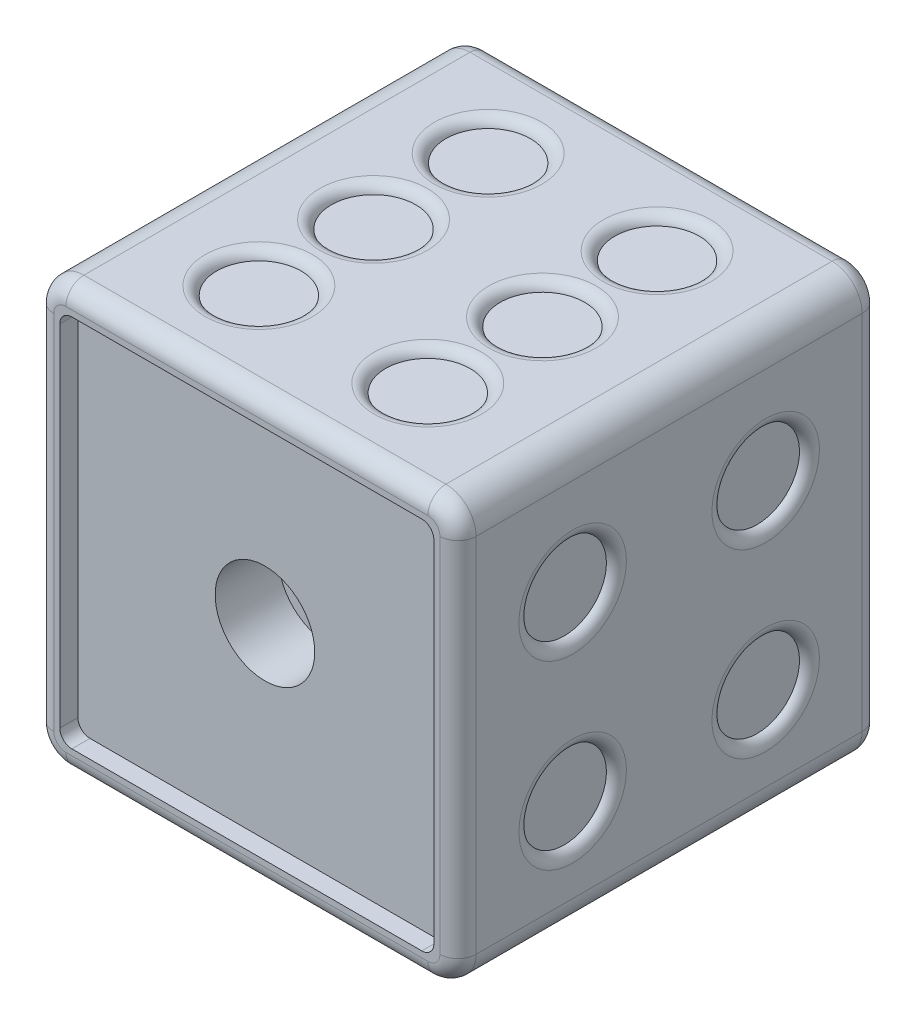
ISO-10303-21;
HEADER;
FILE_DESCRIPTION(('STEP AP214'),'2;1');
FILE_NAME('part.step','',(''),(''),'','','');
FILE_SCHEMA(('AUTOMOTIVE_DESIGN { 1 0 10303 214 1 1 1 1 }'));
ENDSEC;
DATA;
#1=APPLICATION_CONTEXT('core data for automotive mechanical design processes');
#2=APPLICATION_PROTOCOL_DEFINITION('international standard','automotive_design',2000,#1);
#3=PRODUCT_CONTEXT('',#1,'mechanical');
#4=PRODUCT('Part','Part','',(#3));
#5=PRODUCT_RELATED_PRODUCT_CATEGORY('part','',(#4));
#6=PRODUCT_DEFINITION_FORMATION('','',#4);
#7=PRODUCT_DEFINITION_CONTEXT('part definition',#1,'design');
#8=PRODUCT_DEFINITION('design','',#6,#7);
#9=PRODUCT_DEFINITION_SHAPE('','',#8);
#10=(LENGTH_UNIT() NAMED_UNIT(*) SI_UNIT(.MILLI.,.METRE.));
#11=(NAMED_UNIT(*) PLANE_ANGLE_UNIT() SI_UNIT($,.RADIAN.));
#12=(NAMED_UNIT(*) SI_UNIT($,.STERADIAN.) SOLID_ANGLE_UNIT());
#13=UNCERTAINTY_MEASURE_WITH_UNIT(LENGTH_MEASURE(1.E-05),#10,'distance_accuracy_value','');
#14=(GEOMETRIC_REPRESENTATION_CONTEXT(3) GLOBAL_UNCERTAINTY_ASSIGNED_CONTEXT((#13)) GLOBAL_UNIT_ASSIGNED_CONTEXT((#10,
#11,#12)) REPRESENTATION_CONTEXT('',''));
#15=CARTESIAN_POINT('',(0.,0.,0.));
#16=DIRECTION('',(0.,0.,1.));
#17=DIRECTION('',(1.,0.,0.));
#18=AXIS2_PLACEMENT_3D('',#15,#16,#17);
#19=CARTESIAN_POINT('',(-17.5,-17.5,35.));
#20=DIRECTION('',(1.,0.,0.));
#21=DIRECTION('',(0.,0.,-1.));
#22=AXIS2_PLACEMENT_3D('',#19,#20,#21);
#23=PLANE('',#22);
#24=CARTESIAN_POINT('',(-17.5,8.00000000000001,9.5));
#25=DIRECTION('',(1.,0.,0.));
#26=DIRECTION('',(0.,0.,-1.));
#27=AXIS2_PLACEMENT_3D('',#24,#25,#26);
#28=CIRCLE('',#27,4.45393920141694);
#29=CARTESIAN_POINT('',(-17.5,8.00000000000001,5.04606079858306));
#30=VERTEX_POINT('',#29);
#31=EDGE_CURVE('E450',#30,#30,#28,.T.);
#32=ORIENTED_EDGE('',*,*,#31,.T.);
#33=EDGE_LOOP('',(#32));
#34=FACE_BOUND('',#33,.T.);
#35=CARTESIAN_POINT('',(-17.5,0.,17.5));
#36=DIRECTION('',(1.,0.,0.));
#37=DIRECTION('',(0.,0.,-1.));
#38=AXIS2_PLACEMENT_3D('',#35,#36,#37);
#39=CIRCLE('',#38,4.45393920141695);
#40=CARTESIAN_POINT('',(-17.5,0.,13.0460607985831));
#41=VERTEX_POINT('',#40);
#42=EDGE_CURVE('E447',#41,#41,#39,.T.);
#43=ORIENTED_EDGE('',*,*,#42,.T.);
#44=EDGE_LOOP('',(#43));
#45=FACE_BOUND('',#44,.T.);
#46=CARTESIAN_POINT('',(-17.5,-8.49896049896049,24.9677754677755));
#47=DIRECTION('',(1.,0.,0.));
#48=DIRECTION('',(0.,0.,-1.));
#49=AXIS2_PLACEMENT_3D('',#46,#47,#48);
#50=CIRCLE('',#49,4.45393920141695);
#51=CARTESIAN_POINT('',(-17.5,-8.49896049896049,20.5138362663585));
#52=VERTEX_POINT('',#51);
#53=EDGE_CURVE('E444',#52,#52,#50,.T.);
#54=ORIENTED_EDGE('',*,*,#53,.T.);
#55=EDGE_LOOP('',(#54));
#56=FACE_BOUND('',#55,.T.);
#57=DIRECTION('',(0.,0.,-1.));
#58=VECTOR('',#57,1.);
#59=CARTESIAN_POINT('',(-17.5,-15.,35.));
#60=LINE('',#59,#58);
#61=CARTESIAN_POINT('',(-17.5,-15.,1.5));
#62=VERTEX_POINT('',#61);
#63=CARTESIAN_POINT('',(-17.5,-15.,33.5));
#64=VERTEX_POINT('',#63);
#65=EDGE_CURVE('E276',#62,#64,#60,.F.);
#66=ORIENTED_EDGE('',*,*,#65,.T.);
#67=DIRECTION('',(0.,-1.,0.));
#68=VECTOR('',#67,1.);
#69=CARTESIAN_POINT('',(-17.5,15.,33.5));
#70=LINE('',#69,#68);
#71=CARTESIAN_POINT('',(-17.5,15.,33.5));
#72=VERTEX_POINT('',#71);
#73=EDGE_CURVE('E325',#64,#72,#70,.F.);
#74=ORIENTED_EDGE('',*,*,#73,.T.);
#75=DIRECTION('',(0.,0.,-1.));
#76=VECTOR('',#75,1.);
#77=CARTESIAN_POINT('',(-17.5,15.,35.));
#78=LINE('',#77,#76);
#79=CARTESIAN_POINT('',(-17.5,15.,1.5));
#80=VERTEX_POINT('',#79);
#81=EDGE_CURVE('E279',#72,#80,#78,.T.);
#82=ORIENTED_EDGE('',*,*,#81,.T.);
#83=DIRECTION('',(0.,-1.,0.));
#84=VECTOR('',#83,1.);
#85=CARTESIAN_POINT('',(-17.5,-17.5,1.5));
#86=LINE('',#85,#84);
#87=EDGE_CURVE('E323',#80,#62,#86,.T.);
#88=ORIENTED_EDGE('',*,*,#87,.T.);
#89=EDGE_LOOP('',(#66,#74,#82,#88));
#90=FACE_BOUND('',#89,.T.);
#91=ADVANCED_FACE('F47',(#34,#45,#56,#90),#23,.F.);
#92=CARTESIAN_POINT('',(17.5,-17.5,35.));
#93=DIRECTION('',(0.,1.,0.));
#94=DIRECTION('',(-1.,0.,0.));
#95=AXIS2_PLACEMENT_3D('',#92,#93,#94);
#96=PLANE('',#95);
#97=CARTESIAN_POINT('',(0.,-17.5,17.5));
#98=DIRECTION('',(0.,1.,0.));
#99=DIRECTION('',(-1.,0.,0.));
#100=AXIS2_PLACEMENT_3D('',#97,#98,#99);
#101=CIRCLE('',#100,4.45393920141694);
#102=CARTESIAN_POINT('',(-4.45393920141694,-17.5,17.5));
#103=VERTEX_POINT('',#102);
#104=EDGE_CURVE('E453',#103,#103,#101,.T.);
#105=ORIENTED_EDGE('',*,*,#104,.T.);
#106=EDGE_LOOP('',(#105));
#107=FACE_BOUND('',#106,.T.);
#108=DIRECTION('',(0.,0.,-1.));
#109=VECTOR('',#108,1.);
#110=CARTESIAN_POINT('',(15.,-17.5,35.));
#111=LINE('',#110,#109);
#112=CARTESIAN_POINT('',(15.,-17.5,1.5));
#113=VERTEX_POINT('',#112);
#114=CARTESIAN_POINT('',(15.,-17.5,33.5));
#115=VERTEX_POINT('',#114);
#116=EDGE_CURVE('E297',#113,#115,#111,.F.);
#117=ORIENTED_EDGE('',*,*,#116,.T.);
#118=DIRECTION('',(1.,0.,0.));
#119=VECTOR('',#118,1.);
#120=CARTESIAN_POINT('',(-15.,-17.5,33.5));
#121=LINE('',#120,#119);
#122=CARTESIAN_POINT('',(-15.,-17.5,33.5));
#123=VERTEX_POINT('',#122);
#124=EDGE_CURVE('E364',#115,#123,#121,.F.);
#125=ORIENTED_EDGE('',*,*,#124,.T.);
#126=DIRECTION('',(0.,0.,-1.));
#127=VECTOR('',#126,1.);
#128=CARTESIAN_POINT('',(-15.,-17.5,35.));
#129=LINE('',#128,#127);
#130=CARTESIAN_POINT('',(-15.,-17.5,1.5));
#131=VERTEX_POINT('',#130);
#132=EDGE_CURVE('E294',#123,#131,#129,.T.);
#133=ORIENTED_EDGE('',*,*,#132,.T.);
#134=DIRECTION('',(1.,0.,0.));
#135=VECTOR('',#134,1.);
#136=CARTESIAN_POINT('',(17.5,-17.5,1.5));
#137=LINE('',#136,#135);
#138=EDGE_CURVE('E362',#131,#113,#137,.T.);
#139=ORIENTED_EDGE('',*,*,#138,.T.);
#140=EDGE_LOOP('',(#117,#125,#133,#139));
#141=FACE_BOUND('',#140,.T.);
#142=ADVANCED_FACE('F537',(#107,#141),#96,.F.);
#143=CARTESIAN_POINT('',(17.5,-17.5,35.));
#144=DIRECTION('',(-1.,0.,0.));
#145=DIRECTION('',(0.,-1.,0.));
#146=AXIS2_PLACEMENT_3D('',#143,#144,#145);
#147=PLANE('',#146);
#148=CARTESIAN_POINT('',(17.5,-8.,25.5));
#149=DIRECTION('',(-1.,0.,0.));
#150=DIRECTION('',(0.,-1.,0.));
#151=AXIS2_PLACEMENT_3D('',#148,#149,#150);
#152=CIRCLE('',#151,4.45393920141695);
#153=CARTESIAN_POINT('',(17.5,-12.4539392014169,25.5));
#154=VERTEX_POINT('',#153);
#155=EDGE_CURVE('E11',#154,#154,#152,.T.);
#156=ORIENTED_EDGE('',*,*,#155,.T.);
#157=EDGE_LOOP('',(#156));
#158=FACE_BOUND('',#157,.T.);
#159=CARTESIAN_POINT('',(17.5,-7.99999999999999,9.49999999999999));
#160=DIRECTION('',(-1.,0.,0.));
#161=DIRECTION('',(0.,-1.,0.));
#162=AXIS2_PLACEMENT_3D('',#159,#160,#161);
#163=CIRCLE('',#162,4.45393920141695);
#164=CARTESIAN_POINT('',(17.5,-12.4539392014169,9.49999999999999));
#165=VERTEX_POINT('',#164);
#166=EDGE_CURVE('E55',#165,#165,#163,.T.);
#167=ORIENTED_EDGE('',*,*,#166,.T.);
#168=EDGE_LOOP('',(#167));
#169=FACE_BOUND('',#168,.T.);
#170=CARTESIAN_POINT('',(17.5,7.00000000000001,9.5));
#171=DIRECTION('',(-1.,0.,0.));
#172=DIRECTION('',(0.,-1.,0.));
#173=AXIS2_PLACEMENT_3D('',#170,#171,#172);
#174=CIRCLE('',#173,4.45393920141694);
#175=CARTESIAN_POINT('',(17.5,2.54606079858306,9.5));
#176=VERTEX_POINT('',#175);
#177=EDGE_CURVE('E459',#176,#176,#174,.T.);
#178=ORIENTED_EDGE('',*,*,#177,.T.);
#179=EDGE_LOOP('',(#178));
#180=FACE_BOUND('',#179,.T.);
#181=CARTESIAN_POINT('',(17.5,7.,25.5));
#182=DIRECTION('',(-1.,0.,0.));
#183=DIRECTION('',(0.,-1.,0.));
#184=AXIS2_PLACEMENT_3D('',#181,#182,#183);
#185=CIRCLE('',#184,4.45393920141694);
#186=CARTESIAN_POINT('',(17.5,2.54606079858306,25.5));
#187=VERTEX_POINT('',#186);
#188=EDGE_CURVE('E456',#187,#187,#185,.T.);
#189=ORIENTED_EDGE('',*,*,#188,.T.);
#190=EDGE_LOOP('',(#189));
#191=FACE_BOUND('',#190,.T.);
#192=DIRECTION('',(0.,0.,-1.));
#193=VECTOR('',#192,1.);
#194=CARTESIAN_POINT('',(17.5,15.,35.));
#195=LINE('',#194,#193);
#196=CARTESIAN_POINT('',(17.5,15.,1.5));
#197=VERTEX_POINT('',#196);
#198=CARTESIAN_POINT('',(17.5,15.,33.5));
#199=VERTEX_POINT('',#198);
#200=EDGE_CURVE('E291',#197,#199,#195,.F.);
#201=ORIENTED_EDGE('',*,*,#200,.T.);
#202=DIRECTION('',(0.,1.,0.));
#203=VECTOR('',#202,1.);
#204=CARTESIAN_POINT('',(17.5,-15.,33.5));
#205=LINE('',#204,#203);
#206=CARTESIAN_POINT('',(17.5,-15.,33.5));
#207=VERTEX_POINT('',#206);
#208=EDGE_CURVE('E341',#199,#207,#205,.F.);
#209=ORIENTED_EDGE('',*,*,#208,.T.);
#210=DIRECTION('',(0.,0.,-1.));
#211=VECTOR('',#210,1.);
#212=CARTESIAN_POINT('',(17.5,-15.,35.));
#213=LINE('',#212,#211);
#214=CARTESIAN_POINT('',(17.5,-15.,1.5));
#215=VERTEX_POINT('',#214);
#216=EDGE_CURVE('E288',#207,#215,#213,.T.);
#217=ORIENTED_EDGE('',*,*,#216,.T.);
#218=DIRECTION('',(0.,1.,0.));
#219=VECTOR('',#218,1.);
#220=CARTESIAN_POINT('',(17.5,-17.5,1.5));
#221=LINE('',#220,#219);
#222=EDGE_CURVE('E339',#215,#197,#221,.T.);
#223=ORIENTED_EDGE('',*,*,#222,.T.);
#224=EDGE_LOOP('',(#201,#209,#217,#223));
#225=FACE_BOUND('',#224,.T.);
#226=ADVANCED_FACE('F464',(#158,#169,#180,#191,#225),#147,.F.);
#227=CARTESIAN_POINT('',(17.5,17.5,35.));
#228=DIRECTION('',(0.,-1.,0.));
#229=DIRECTION('',(1.,0.,0.));
#230=AXIS2_PLACEMENT_3D('',#227,#228,#229);
#231=PLANE('',#230);
#232=CARTESIAN_POINT('',(7.00000000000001,17.5,27.));
#233=DIRECTION('',(0.,-1.,0.));
#234=DIRECTION('',(1.,0.,0.));
#235=AXIS2_PLACEMENT_3D('',#232,#233,#234);
#236=CIRCLE('',#235,4.45393920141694);
#237=CARTESIAN_POINT('',(11.453939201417,17.5,27.));
#238=VERTEX_POINT('',#237);
#239=EDGE_CURVE('E441',#238,#238,#236,.T.);
#240=ORIENTED_EDGE('',*,*,#239,.T.);
#241=EDGE_LOOP('',(#240));
#242=FACE_BOUND('',#241,.T.);
#243=CARTESIAN_POINT('',(7.,17.5,17.5));
#244=DIRECTION('',(0.,-1.,0.));
#245=DIRECTION('',(1.,0.,0.));
#246=AXIS2_PLACEMENT_3D('',#243,#244,#245);
#247=CIRCLE('',#246,4.45393920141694);
#248=CARTESIAN_POINT('',(11.4539392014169,17.5,17.5));
#249=VERTEX_POINT('',#248);
#250=EDGE_CURVE('E438',#249,#249,#247,.T.);
#251=ORIENTED_EDGE('',*,*,#250,.T.);
#252=EDGE_LOOP('',(#251));
#253=FACE_BOUND('',#252,.T.);
#254=CARTESIAN_POINT('',(7.,17.5,8.));
#255=DIRECTION('',(0.,-1.,0.));
#256=DIRECTION('',(1.,0.,0.));
#257=AXIS2_PLACEMENT_3D('',#254,#255,#256);
#258=CIRCLE('',#257,4.45393920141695);
#259=CARTESIAN_POINT('',(11.4539392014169,17.5,8.));
#260=VERTEX_POINT('',#259);
#261=EDGE_CURVE('E435',#260,#260,#258,.T.);
#262=ORIENTED_EDGE('',*,*,#261,.T.);
#263=EDGE_LOOP('',(#262));
#264=FACE_BOUND('',#263,.T.);
#265=CARTESIAN_POINT('',(-7.00000000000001,17.5,8.));
#266=DIRECTION('',(0.,-1.,0.));
#267=DIRECTION('',(1.,0.,0.));
#268=AXIS2_PLACEMENT_3D('',#265,#266,#267);
#269=CIRCLE('',#268,4.45393920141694);
#270=CARTESIAN_POINT('',(-2.54606079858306,17.5,8.));
#271=VERTEX_POINT('',#270);
#272=EDGE_CURVE('E432',#271,#271,#269,.T.);
#273=ORIENTED_EDGE('',*,*,#272,.T.);
#274=EDGE_LOOP('',(#273));
#275=FACE_BOUND('',#274,.T.);
#276=CARTESIAN_POINT('',(-7.,17.5,17.5));
#277=DIRECTION('',(0.,-1.,0.));
#278=DIRECTION('',(1.,0.,0.));
#279=AXIS2_PLACEMENT_3D('',#276,#277,#278);
#280=CIRCLE('',#279,4.45393920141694);
#281=CARTESIAN_POINT('',(-2.54606079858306,17.5,17.5));
#282=VERTEX_POINT('',#281);
#283=EDGE_CURVE('E429',#282,#282,#280,.T.);
#284=ORIENTED_EDGE('',*,*,#283,.T.);
#285=EDGE_LOOP('',(#284));
#286=FACE_BOUND('',#285,.T.);
#287=CARTESIAN_POINT('',(-7.00000000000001,17.5,27.));
#288=DIRECTION('',(0.,-1.,0.));
#289=DIRECTION('',(1.,0.,0.));
#290=AXIS2_PLACEMENT_3D('',#287,#288,#289);
#291=CIRCLE('',#290,4.45393920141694);
#292=CARTESIAN_POINT('',(-2.54606079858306,17.5,27.));
#293=VERTEX_POINT('',#292);
#294=EDGE_CURVE('E426',#293,#293,#291,.T.);
#295=ORIENTED_EDGE('',*,*,#294,.T.);
#296=EDGE_LOOP('',(#295));
#297=FACE_BOUND('',#296,.T.);
#298=DIRECTION('',(0.,0.,-1.));
#299=VECTOR('',#298,1.);
#300=CARTESIAN_POINT('',(-15.,17.5,35.));
#301=LINE('',#300,#299);
#302=CARTESIAN_POINT('',(-15.,17.5,1.5));
#303=VERTEX_POINT('',#302);
#304=CARTESIAN_POINT('',(-15.,17.5,33.5));
#305=VERTEX_POINT('',#304);
#306=EDGE_CURVE('E285',#303,#305,#301,.F.);
#307=ORIENTED_EDGE('',*,*,#306,.T.);
#308=DIRECTION('',(-1.,0.,0.));
#309=VECTOR('',#308,1.);
#310=CARTESIAN_POINT('',(15.,17.5,33.5));
#311=LINE('',#310,#309);
#312=CARTESIAN_POINT('',(15.,17.5,33.5));
#313=VERTEX_POINT('',#312);
#314=EDGE_CURVE('E333',#305,#313,#311,.F.);
#315=ORIENTED_EDGE('',*,*,#314,.T.);
#316=DIRECTION('',(0.,0.,-1.));
#317=VECTOR('',#316,1.);
#318=CARTESIAN_POINT('',(15.,17.5,35.));
#319=LINE('',#318,#317);
#320=CARTESIAN_POINT('',(15.,17.5,1.5));
#321=VERTEX_POINT('',#320);
#322=EDGE_CURVE('E282',#313,#321,#319,.T.);
#323=ORIENTED_EDGE('',*,*,#322,.T.);
#324=DIRECTION('',(-1.,0.,0.));
#325=VECTOR('',#324,1.);
#326=CARTESIAN_POINT('',(17.5,17.5,1.5));
#327=LINE('',#326,#325);
#328=EDGE_CURVE('E331',#321,#303,#327,.T.);
#329=ORIENTED_EDGE('',*,*,#328,.T.);
#330=EDGE_LOOP('',(#307,#315,#323,#329));
#331=FACE_BOUND('',#330,.T.);
#332=ADVANCED_FACE('F549',(#242,#253,#264,#275,#286,#297,#331),#231,.F.);
#333=CARTESIAN_POINT('',(0.,0.,35.));
#334=DIRECTION('',(0.,0.,1.));
#335=DIRECTION('',(1.,0.,0.));
#336=AXIS2_PLACEMENT_3D('',#333,#334,#335);
#337=PLANE('',#336);
#338=DIRECTION('',(0.,-1.,0.));
#339=VECTOR('',#338,1.);
#340=CARTESIAN_POINT('',(-16.,-15.,35.));
#341=LINE('',#340,#339);
#342=CARTESIAN_POINT('',(-16.,15.,35.));
#343=VERTEX_POINT('',#342);
#344=CARTESIAN_POINT('',(-16.,-15.,35.));
#345=VERTEX_POINT('',#344);
#346=EDGE_CURVE('E312',#343,#345,#341,.T.);
#347=ORIENTED_EDGE('',*,*,#346,.T.);
#348=CARTESIAN_POINT('',(-15.,-15.,35.));
#349=DIRECTION('',(0.,0.,1.));
#350=DIRECTION('',(1.,0.,0.));
#351=AXIS2_PLACEMENT_3D('',#348,#349,#350);
#352=CIRCLE('',#351,1.);
#353=CARTESIAN_POINT('',(-15.,-16.,35.));
#354=VERTEX_POINT('',#353);
#355=EDGE_CURVE('E314',#345,#354,#352,.T.);
#356=ORIENTED_EDGE('',*,*,#355,.T.);
#357=DIRECTION('',(1.,0.,0.));
#358=VECTOR('',#357,1.);
#359=CARTESIAN_POINT('',(15.,-16.,35.));
#360=LINE('',#359,#358);
#361=CARTESIAN_POINT('',(15.,-16.,35.));
#362=VERTEX_POINT('',#361);
#363=EDGE_CURVE('E300',#354,#362,#360,.T.);
#364=ORIENTED_EDGE('',*,*,#363,.T.);
#365=CARTESIAN_POINT('',(15.,-15.,35.));
#366=DIRECTION('',(0.,0.,1.));
#367=DIRECTION('',(1.,0.,0.));
#368=AXIS2_PLACEMENT_3D('',#365,#366,#367);
#369=CIRCLE('',#368,1.);
#370=CARTESIAN_POINT('',(16.,-15.,35.));
#371=VERTEX_POINT('',#370);
#372=EDGE_CURVE('E302',#362,#371,#369,.T.);
#373=ORIENTED_EDGE('',*,*,#372,.T.);
#374=DIRECTION('',(0.,1.,0.));
#375=VECTOR('',#374,1.);
#376=CARTESIAN_POINT('',(16.,15.,35.));
#377=LINE('',#376,#375);
#378=CARTESIAN_POINT('',(16.,15.,35.));
#379=VERTEX_POINT('',#378);
#380=EDGE_CURVE('E304',#371,#379,#377,.T.);
#381=ORIENTED_EDGE('',*,*,#380,.T.);
#382=CARTESIAN_POINT('',(15.,15.,35.));
#383=DIRECTION('',(0.,0.,1.));
#384=DIRECTION('',(1.,0.,0.));
#385=AXIS2_PLACEMENT_3D('',#382,#383,#384);
#386=CIRCLE('',#385,1.);
#387=CARTESIAN_POINT('',(15.,16.,35.));
#388=VERTEX_POINT('',#387);
#389=EDGE_CURVE('E306',#379,#388,#386,.T.);
#390=ORIENTED_EDGE('',*,*,#389,.T.);
#391=DIRECTION('',(-1.,0.,0.));
#392=VECTOR('',#391,1.);
#393=CARTESIAN_POINT('',(-15.,16.,35.));
#394=LINE('',#393,#392);
#395=CARTESIAN_POINT('',(-15.,16.,35.));
#396=VERTEX_POINT('',#395);
#397=EDGE_CURVE('E308',#388,#396,#394,.T.);
#398=ORIENTED_EDGE('',*,*,#397,.T.);
#399=CARTESIAN_POINT('',(-15.,15.,35.));
#400=DIRECTION('',(0.,0.,1.));
#401=DIRECTION('',(1.,0.,0.));
#402=AXIS2_PLACEMENT_3D('',#399,#400,#401);
#403=CIRCLE('',#402,1.);
#404=EDGE_CURVE('E310',#396,#343,#403,.T.);
#405=ORIENTED_EDGE('',*,*,#404,.T.);
#406=EDGE_LOOP('',(#347,#356,#364,#373,#381,#390,#398,#405));
#407=FACE_BOUND('',#406,.T.);
#408=DIRECTION('',(0.,-1.,0.));
#409=VECTOR('',#408,1.);
#410=CARTESIAN_POINT('',(-15.5,-15.5,35.));
#411=LINE('',#410,#409);
#412=CARTESIAN_POINT('',(-15.5,14.5,35.));
#413=VERTEX_POINT('',#412);
#414=CARTESIAN_POINT('',(-15.5,-14.5,35.));
#415=VERTEX_POINT('',#414);
#416=EDGE_CURVE('E237',#413,#415,#411,.T.);
#417=ORIENTED_EDGE('',*,*,#416,.F.);
#418=CARTESIAN_POINT('',(-14.5,14.5,35.));
#419=DIRECTION('',(0.,0.,1.));
#420=DIRECTION('',(1.,0.,0.));
#421=AXIS2_PLACEMENT_3D('',#418,#419,#420);
#422=CIRCLE('',#421,1.);
#423=CARTESIAN_POINT('',(-14.5,15.5,35.));
#424=VERTEX_POINT('',#423);
#425=EDGE_CURVE('E274',#413,#424,#422,.F.);
#426=ORIENTED_EDGE('',*,*,#425,.T.);
#427=DIRECTION('',(-1.,0.,0.));
#428=VECTOR('',#427,1.);
#429=CARTESIAN_POINT('',(15.5,15.5,35.));
#430=LINE('',#429,#428);
#431=CARTESIAN_POINT('',(14.5,15.5,35.));
#432=VERTEX_POINT('',#431);
#433=EDGE_CURVE('E240',#432,#424,#430,.T.);
#434=ORIENTED_EDGE('',*,*,#433,.F.);
#435=CARTESIAN_POINT('',(14.5,14.5,35.));
#436=DIRECTION('',(0.,0.,1.));
#437=DIRECTION('',(1.,0.,0.));
#438=AXIS2_PLACEMENT_3D('',#435,#436,#437);
#439=CIRCLE('',#438,1.);
#440=CARTESIAN_POINT('',(15.5,14.5,35.));
#441=VERTEX_POINT('',#440);
#442=EDGE_CURVE('E272',#432,#441,#439,.F.);
#443=ORIENTED_EDGE('',*,*,#442,.T.);
#444=DIRECTION('',(0.,1.,0.));
#445=VECTOR('',#444,1.);
#446=CARTESIAN_POINT('',(15.5,-15.5,35.));
#447=LINE('',#446,#445);
#448=CARTESIAN_POINT('',(15.5,-14.5,35.));
#449=VERTEX_POINT('',#448);
#450=EDGE_CURVE('E236',#449,#441,#447,.T.);
#451=ORIENTED_EDGE('',*,*,#450,.F.);
#452=CARTESIAN_POINT('',(14.5,-14.5,35.));
#453=DIRECTION('',(0.,0.,1.));
#454=DIRECTION('',(1.,0.,0.));
#455=AXIS2_PLACEMENT_3D('',#452,#453,#454);
#456=CIRCLE('',#455,1.);
#457=CARTESIAN_POINT('',(14.5,-15.5,35.));
#458=VERTEX_POINT('',#457);
#459=EDGE_CURVE('E220',#449,#458,#456,.F.);
#460=ORIENTED_EDGE('',*,*,#459,.T.);
#461=DIRECTION('',(1.,0.,0.));
#462=VECTOR('',#461,1.);
#463=CARTESIAN_POINT('',(15.5,-15.5,35.));
#464=LINE('',#463,#462);
#465=CARTESIAN_POINT('',(-14.5,-15.5,35.));
#466=VERTEX_POINT('',#465);
#467=EDGE_CURVE('E227',#466,#458,#464,.T.);
#468=ORIENTED_EDGE('',*,*,#467,.F.);
#469=CARTESIAN_POINT('',(-14.5,-14.5,35.));
#470=DIRECTION('',(0.,0.,1.));
#471=DIRECTION('',(1.,0.,0.));
#472=AXIS2_PLACEMENT_3D('',#469,#470,#471);
#473=CIRCLE('',#472,1.);
#474=EDGE_CURVE('E210',#466,#415,#473,.F.);
#475=ORIENTED_EDGE('',*,*,#474,.T.);
#476=EDGE_LOOP('',(#417,#426,#434,#443,#451,#460,#468,#475));
#477=FACE_BOUND('',#476,.T.);
#478=ADVANCED_FACE('F234',(#407,#477),#337,.T.);
#479=CARTESIAN_POINT('',(0.,0.,0.));
#480=DIRECTION('',(0.,0.,1.));
#481=DIRECTION('',(1.,0.,0.));
#482=AXIS2_PLACEMENT_3D('',#479,#480,#481);
#483=PLANE('',#482);
#484=CARTESIAN_POINT('',(-8.00000000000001,-9.,0.));
#485=DIRECTION('',(0.,0.,1.));
#486=DIRECTION('',(1.,0.,0.));
#487=AXIS2_PLACEMENT_3D('',#484,#485,#486);
#488=CIRCLE('',#487,4.45393920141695);
#489=CARTESIAN_POINT('',(-3.54606079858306,-9.,0.));
#490=VERTEX_POINT('',#489);
#491=EDGE_CURVE('E423',#490,#490,#488,.T.);
#492=ORIENTED_EDGE('',*,*,#491,.T.);
#493=EDGE_LOOP('',(#492));
#494=FACE_BOUND('',#493,.T.);
#495=CARTESIAN_POINT('',(8.00000000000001,-9.,0.));
#496=DIRECTION('',(0.,0.,1.));
#497=DIRECTION('',(1.,0.,0.));
#498=AXIS2_PLACEMENT_3D('',#495,#496,#497);
#499=CIRCLE('',#498,4.45393920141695);
#500=CARTESIAN_POINT('',(12.453939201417,-9.,0.));
#501=VERTEX_POINT('',#500);
#502=EDGE_CURVE('E420',#501,#501,#499,.T.);
#503=ORIENTED_EDGE('',*,*,#502,.T.);
#504=EDGE_LOOP('',(#503));
#505=FACE_BOUND('',#504,.T.);
#506=CARTESIAN_POINT('',(0.,0.,0.));
#507=DIRECTION('',(0.,0.,1.));
#508=DIRECTION('',(1.,0.,0.));
#509=AXIS2_PLACEMENT_3D('',#506,#507,#508);
#510=CIRCLE('',#509,4.45393920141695);
#511=CARTESIAN_POINT('',(4.45393920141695,0.,0.));
#512=VERTEX_POINT('',#511);
#513=EDGE_CURVE('E417',#512,#512,#510,.T.);
#514=ORIENTED_EDGE('',*,*,#513,.T.);
#515=EDGE_LOOP('',(#514));
#516=FACE_BOUND('',#515,.T.);
#517=CARTESIAN_POINT('',(-8.00000000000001,9.00000000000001,0.));
#518=DIRECTION('',(0.,0.,1.));
#519=DIRECTION('',(1.,0.,0.));
#520=AXIS2_PLACEMENT_3D('',#517,#518,#519);
#521=CIRCLE('',#520,4.45393920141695);
#522=CARTESIAN_POINT('',(-3.54606079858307,9.00000000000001,0.));
#523=VERTEX_POINT('',#522);
#524=EDGE_CURVE('E414',#523,#523,#521,.T.);
#525=ORIENTED_EDGE('',*,*,#524,.T.);
#526=EDGE_LOOP('',(#525));
#527=FACE_BOUND('',#526,.T.);
#528=CARTESIAN_POINT('',(8.00000000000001,9.00000000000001,0.));
#529=DIRECTION('',(0.,0.,1.));
#530=DIRECTION('',(1.,0.,0.));
#531=AXIS2_PLACEMENT_3D('',#528,#529,#530);
#532=CIRCLE('',#531,4.45393920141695);
#533=CARTESIAN_POINT('',(12.453939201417,9.00000000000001,0.));
#534=VERTEX_POINT('',#533);
#535=EDGE_CURVE('E366',#534,#534,#532,.T.);
#536=ORIENTED_EDGE('',*,*,#535,.T.);
#537=EDGE_LOOP('',(#536));
#538=FACE_BOUND('',#537,.T.);
#539=DIRECTION('',(1.,0.,0.));
#540=VECTOR('',#539,1.);
#541=CARTESIAN_POINT('',(0.,-16.,0.));
#542=LINE('',#541,#540);
#543=CARTESIAN_POINT('',(15.,-16.,0.));
#544=VERTEX_POINT('',#543);
#545=CARTESIAN_POINT('',(-15.,-16.,0.));
#546=VERTEX_POINT('',#545);
#547=EDGE_CURVE('E347',#544,#546,#542,.F.);
#548=ORIENTED_EDGE('',*,*,#547,.T.);
#549=CARTESIAN_POINT('',(-15.,-15.,0.));
#550=DIRECTION('',(0.,0.,1.));
#551=DIRECTION('',(1.,0.,0.));
#552=AXIS2_PLACEMENT_3D('',#549,#550,#551);
#553=CIRCLE('',#552,1.);
#554=CARTESIAN_POINT('',(-16.,-15.,0.));
#555=VERTEX_POINT('',#554);
#556=EDGE_CURVE('E360',#546,#555,#553,.F.);
#557=ORIENTED_EDGE('',*,*,#556,.T.);
#558=DIRECTION('',(0.,-1.,0.));
#559=VECTOR('',#558,1.);
#560=CARTESIAN_POINT('',(-16.,0.,0.));
#561=LINE('',#560,#559);
#562=CARTESIAN_POINT('',(-16.,15.,0.));
#563=VERTEX_POINT('',#562);
#564=EDGE_CURVE('E69',#555,#563,#561,.F.);
#565=ORIENTED_EDGE('',*,*,#564,.T.);
#566=CARTESIAN_POINT('',(-15.,15.,0.));
#567=DIRECTION('',(0.,0.,1.));
#568=DIRECTION('',(1.,0.,0.));
#569=AXIS2_PLACEMENT_3D('',#566,#567,#568);
#570=CIRCLE('',#569,1.);
#571=CARTESIAN_POINT('',(-15.,16.,0.));
#572=VERTEX_POINT('',#571);
#573=EDGE_CURVE('E357',#563,#572,#570,.F.);
#574=ORIENTED_EDGE('',*,*,#573,.T.);
#575=DIRECTION('',(-1.,0.,0.));
#576=VECTOR('',#575,1.);
#577=CARTESIAN_POINT('',(0.,16.,0.));
#578=LINE('',#577,#576);
#579=CARTESIAN_POINT('',(15.,16.,0.));
#580=VERTEX_POINT('',#579);
#581=EDGE_CURVE('E355',#572,#580,#578,.F.);
#582=ORIENTED_EDGE('',*,*,#581,.T.);
#583=CARTESIAN_POINT('',(15.,15.,0.));
#584=DIRECTION('',(0.,0.,1.));
#585=DIRECTION('',(1.,0.,0.));
#586=AXIS2_PLACEMENT_3D('',#583,#584,#585);
#587=CIRCLE('',#586,1.);
#588=CARTESIAN_POINT('',(16.,15.,0.));
#589=VERTEX_POINT('',#588);
#590=EDGE_CURVE('E353',#580,#589,#587,.F.);
#591=ORIENTED_EDGE('',*,*,#590,.T.);
#592=DIRECTION('',(0.,1.,0.));
#593=VECTOR('',#592,1.);
#594=CARTESIAN_POINT('',(16.,0.,0.));
#595=LINE('',#594,#593);
#596=CARTESIAN_POINT('',(16.,-15.,0.));
#597=VERTEX_POINT('',#596);
#598=EDGE_CURVE('E351',#589,#597,#595,.F.);
#599=ORIENTED_EDGE('',*,*,#598,.T.);
#600=CARTESIAN_POINT('',(15.,-15.,0.));
#601=DIRECTION('',(0.,0.,1.));
#602=DIRECTION('',(1.,0.,0.));
#603=AXIS2_PLACEMENT_3D('',#600,#601,#602);
#604=CIRCLE('',#603,1.);
#605=EDGE_CURVE('E349',#597,#544,#604,.F.);
#606=ORIENTED_EDGE('',*,*,#605,.T.);
#607=EDGE_LOOP('',(#548,#557,#565,#574,#582,#591,#599,#606));
#608=FACE_BOUND('',#607,.T.);
#609=ADVANCED_FACE('F554',(#494,#505,#516,#527,#538,#608),#483,.F.);
#610=CARTESIAN_POINT('',(-15.5,-15.5,33.5));
#611=DIRECTION('',(-1.,0.,0.));
#612=DIRECTION('',(0.,0.,1.));
#613=AXIS2_PLACEMENT_3D('',#610,#611,#612);
#614=PLANE('',#613);
#615=ORIENTED_EDGE('',*,*,#416,.T.);
#616=DIRECTION('',(0.,0.,1.));
#617=VECTOR('',#616,1.);
#618=CARTESIAN_POINT('',(-15.5,-14.5,33.5));
#619=LINE('',#618,#617);
#620=CARTESIAN_POINT('',(-15.5,-14.5,33.5));
#621=VERTEX_POINT('',#620);
#622=EDGE_CURVE('E215',#415,#621,#619,.F.);
#623=ORIENTED_EDGE('',*,*,#622,.T.);
#624=DIRECTION('',(0.,-1.,0.));
#625=VECTOR('',#624,1.);
#626=CARTESIAN_POINT('',(-15.5,-15.5,33.5));
#627=LINE('',#626,#625);
#628=CARTESIAN_POINT('',(-15.5,14.5,33.5));
#629=VERTEX_POINT('',#628);
#630=EDGE_CURVE('E248',#629,#621,#627,.T.);
#631=ORIENTED_EDGE('',*,*,#630,.F.);
#632=DIRECTION('',(0.,0.,1.));
#633=VECTOR('',#632,1.);
#634=CARTESIAN_POINT('',(-15.5,14.5,35.));
#635=LINE('',#634,#633);
#636=EDGE_CURVE('E231',#629,#413,#635,.T.);
#637=ORIENTED_EDGE('',*,*,#636,.T.);
#638=EDGE_LOOP('',(#615,#623,#631,#637));
#639=FACE_BOUND('',#638,.T.);
#640=ADVANCED_FACE('F515',(#639),#614,.F.);
#641=CARTESIAN_POINT('',(15.5,15.5,33.5));
#642=DIRECTION('',(0.,1.,0.));
#643=DIRECTION('',(-1.,0.,0.));
#644=AXIS2_PLACEMENT_3D('',#641,#642,#643);
#645=PLANE('',#644);
#646=DIRECTION('',(-1.,0.,0.));
#647=VECTOR('',#646,1.);
#648=CARTESIAN_POINT('',(15.5,15.5,33.5));
#649=LINE('',#648,#647);
#650=CARTESIAN_POINT('',(14.5,15.5,33.5));
#651=VERTEX_POINT('',#650);
#652=CARTESIAN_POINT('',(-14.5,15.5,33.5));
#653=VERTEX_POINT('',#652);
#654=EDGE_CURVE('E249',#651,#653,#649,.T.);
#655=ORIENTED_EDGE('',*,*,#654,.F.);
#656=DIRECTION('',(0.,0.,1.));
#657=VECTOR('',#656,1.);
#658=CARTESIAN_POINT('',(14.5,15.5,35.));
#659=LINE('',#658,#657);
#660=EDGE_CURVE('E221',#651,#432,#659,.T.);
#661=ORIENTED_EDGE('',*,*,#660,.T.);
#662=ORIENTED_EDGE('',*,*,#433,.T.);
#663=DIRECTION('',(0.,0.,1.));
#664=VECTOR('',#663,1.);
#665=CARTESIAN_POINT('',(-14.5,15.5,33.5));
#666=LINE('',#665,#664);
#667=EDGE_CURVE('E267',#424,#653,#666,.F.);
#668=ORIENTED_EDGE('',*,*,#667,.T.);
#669=EDGE_LOOP('',(#655,#661,#662,#668));
#670=FACE_BOUND('',#669,.T.);
#671=ADVANCED_FACE('F517',(#670),#645,.F.);
#672=CARTESIAN_POINT('',(15.5,-15.5,33.5));
#673=DIRECTION('',(1.,0.,0.));
#674=DIRECTION('',(0.,0.,-1.));
#675=AXIS2_PLACEMENT_3D('',#672,#673,#674);
#676=PLANE('',#675);
#677=DIRECTION('',(0.,1.,0.));
#678=VECTOR('',#677,1.);
#679=CARTESIAN_POINT('',(15.5,-15.5,33.5));
#680=LINE('',#679,#678);
#681=CARTESIAN_POINT('',(15.5,-14.5,33.5));
#682=VERTEX_POINT('',#681);
#683=CARTESIAN_POINT('',(15.5,14.5,33.5));
#684=VERTEX_POINT('',#683);
#685=EDGE_CURVE('E499',#682,#684,#680,.T.);
#686=ORIENTED_EDGE('',*,*,#685,.F.);
#687=DIRECTION('',(0.,0.,1.));
#688=VECTOR('',#687,1.);
#689=CARTESIAN_POINT('',(15.5,-14.5,35.));
#690=LINE('',#689,#688);
#691=EDGE_CURVE('E264',#682,#449,#690,.T.);
#692=ORIENTED_EDGE('',*,*,#691,.T.);
#693=ORIENTED_EDGE('',*,*,#450,.T.);
#694=DIRECTION('',(0.,0.,1.));
#695=VECTOR('',#694,1.);
#696=CARTESIAN_POINT('',(15.5,14.5,33.5));
#697=LINE('',#696,#695);
#698=EDGE_CURVE('E262',#441,#684,#697,.F.);
#699=ORIENTED_EDGE('',*,*,#698,.T.);
#700=EDGE_LOOP('',(#686,#692,#693,#699));
#701=FACE_BOUND('',#700,.T.);
#702=ADVANCED_FACE('F523',(#701),#676,.F.);
#703=CARTESIAN_POINT('',(15.5,-15.5,33.5));
#704=DIRECTION('',(0.,-1.,0.));
#705=DIRECTION('',(1.,0.,0.));
#706=AXIS2_PLACEMENT_3D('',#703,#704,#705);
#707=PLANE('',#706);
#708=DIRECTION('',(1.,0.,0.));
#709=VECTOR('',#708,1.);
#710=CARTESIAN_POINT('',(15.5,-15.5,33.5));
#711=LINE('',#710,#709);
#712=CARTESIAN_POINT('',(-14.5,-15.5,33.5));
#713=VERTEX_POINT('',#712);
#714=CARTESIAN_POINT('',(14.5,-15.5,33.5));
#715=VERTEX_POINT('',#714);
#716=EDGE_CURVE('E230',#713,#715,#711,.T.);
#717=ORIENTED_EDGE('',*,*,#716,.F.);
#718=DIRECTION('',(0.,0.,1.));
#719=VECTOR('',#718,1.);
#720=CARTESIAN_POINT('',(-14.5,-15.5,35.));
#721=LINE('',#720,#719);
#722=EDGE_CURVE('E214',#713,#466,#721,.T.);
#723=ORIENTED_EDGE('',*,*,#722,.T.);
#724=ORIENTED_EDGE('',*,*,#467,.T.);
#725=DIRECTION('',(0.,0.,1.));
#726=VECTOR('',#725,1.);
#727=CARTESIAN_POINT('',(14.5,-15.5,33.5));
#728=LINE('',#727,#726);
#729=EDGE_CURVE('E232',#458,#715,#728,.F.);
#730=ORIENTED_EDGE('',*,*,#729,.T.);
#731=EDGE_LOOP('',(#717,#723,#724,#730));
#732=FACE_BOUND('',#731,.T.);
#733=ADVANCED_FACE('F226',(#732),#707,.F.);
#734=CARTESIAN_POINT('',(0.,0.,33.5));
#735=DIRECTION('',(0.,0.,1.));
#736=DIRECTION('',(1.,0.,0.));
#737=AXIS2_PLACEMENT_3D('',#734,#735,#736);
#738=PLANE('',#737);
#739=CARTESIAN_POINT('',(0.,0.,33.5));
#740=DIRECTION('',(0.,0.,1.));
#741=DIRECTION('',(1.,0.,0.));
#742=AXIS2_PLACEMENT_3D('',#739,#740,#741);
#743=CIRCLE('',#742,4.125);
#744=CARTESIAN_POINT('',(4.125,0.,33.5));
#745=VERTEX_POINT('',#744);
#746=EDGE_CURVE('E390',#745,#745,#743,.T.);
#747=ORIENTED_EDGE('',*,*,#746,.F.);
#748=EDGE_LOOP('',(#747));
#749=FACE_BOUND('',#748,.T.);
#750=ORIENTED_EDGE('',*,*,#630,.T.);
#751=CARTESIAN_POINT('',(-14.5,-14.5,33.5));
#752=DIRECTION('',(0.,0.,1.));
#753=DIRECTION('',(1.,0.,0.));
#754=AXIS2_PLACEMENT_3D('',#751,#752,#753);
#755=CIRCLE('',#754,1.);
#756=EDGE_CURVE('E260',#621,#713,#755,.T.);
#757=ORIENTED_EDGE('',*,*,#756,.T.);
#758=ORIENTED_EDGE('',*,*,#716,.T.);
#759=CARTESIAN_POINT('',(14.5,-14.5,33.5));
#760=DIRECTION('',(0.,0.,1.));
#761=DIRECTION('',(1.,0.,0.));
#762=AXIS2_PLACEMENT_3D('',#759,#760,#761);
#763=CIRCLE('',#762,1.);
#764=EDGE_CURVE('E258',#715,#682,#763,.T.);
#765=ORIENTED_EDGE('',*,*,#764,.T.);
#766=ORIENTED_EDGE('',*,*,#685,.T.);
#767=CARTESIAN_POINT('',(14.5,14.5,33.5));
#768=DIRECTION('',(0.,0.,1.));
#769=DIRECTION('',(1.,0.,0.));
#770=AXIS2_PLACEMENT_3D('',#767,#768,#769);
#771=CIRCLE('',#770,1.);
#772=EDGE_CURVE('E256',#684,#651,#771,.T.);
#773=ORIENTED_EDGE('',*,*,#772,.T.);
#774=ORIENTED_EDGE('',*,*,#654,.T.);
#775=CARTESIAN_POINT('',(-14.5,14.5,33.5));
#776=DIRECTION('',(0.,0.,1.));
#777=DIRECTION('',(1.,0.,0.));
#778=AXIS2_PLACEMENT_3D('',#775,#776,#777);
#779=CIRCLE('',#778,1.);
#780=EDGE_CURVE('E254',#653,#629,#779,.T.);
#781=ORIENTED_EDGE('',*,*,#780,.T.);
#782=EDGE_LOOP('',(#750,#757,#758,#765,#766,#773,#774,#781));
#783=FACE_BOUND('',#782,.T.);
#784=ADVANCED_FACE('F505',(#749,#783),#738,.T.);
#785=CARTESIAN_POINT('',(-14.5,-14.5,33.5));
#786=DIRECTION('',(0.,0.,-1.));
#787=DIRECTION('',(-1.,0.,0.));
#788=AXIS2_PLACEMENT_3D('',#785,#786,#787);
#789=CYLINDRICAL_SURFACE('',#788,1.);
#790=ORIENTED_EDGE('',*,*,#756,.F.);
#791=ORIENTED_EDGE('',*,*,#622,.F.);
#792=ORIENTED_EDGE('',*,*,#474,.F.);
#793=ORIENTED_EDGE('',*,*,#722,.F.);
#794=EDGE_LOOP('',(#790,#791,#792,#793));
#795=FACE_BOUND('',#794,.T.);
#796=ADVANCED_FACE('F213',(#795),#789,.F.);
#797=CARTESIAN_POINT('',(14.5,-14.5,33.5));
#798=DIRECTION('',(0.,0.,-1.));
#799=DIRECTION('',(-1.,0.,0.));
#800=AXIS2_PLACEMENT_3D('',#797,#798,#799);
#801=CYLINDRICAL_SURFACE('',#800,1.);
#802=ORIENTED_EDGE('',*,*,#764,.F.);
#803=ORIENTED_EDGE('',*,*,#729,.F.);
#804=ORIENTED_EDGE('',*,*,#459,.F.);
#805=ORIENTED_EDGE('',*,*,#691,.F.);
#806=EDGE_LOOP('',(#802,#803,#804,#805));
#807=FACE_BOUND('',#806,.T.);
#808=ADVANCED_FACE('F527',(#807),#801,.F.);
#809=CARTESIAN_POINT('',(14.5,14.5,33.5));
#810=DIRECTION('',(0.,0.,-1.));
#811=DIRECTION('',(-1.,0.,0.));
#812=AXIS2_PLACEMENT_3D('',#809,#810,#811);
#813=CYLINDRICAL_SURFACE('',#812,1.);
#814=ORIENTED_EDGE('',*,*,#772,.F.);
#815=ORIENTED_EDGE('',*,*,#698,.F.);
#816=ORIENTED_EDGE('',*,*,#442,.F.);
#817=ORIENTED_EDGE('',*,*,#660,.F.);
#818=EDGE_LOOP('',(#814,#815,#816,#817));
#819=FACE_BOUND('',#818,.T.);
#820=ADVANCED_FACE('F519',(#819),#813,.F.);
#821=CARTESIAN_POINT('',(-14.5,14.5,33.5));
#822=DIRECTION('',(0.,0.,-1.));
#823=DIRECTION('',(-1.,0.,0.));
#824=AXIS2_PLACEMENT_3D('',#821,#822,#823);
#825=CYLINDRICAL_SURFACE('',#824,1.);
#826=ORIENTED_EDGE('',*,*,#780,.F.);
#827=ORIENTED_EDGE('',*,*,#667,.F.);
#828=ORIENTED_EDGE('',*,*,#425,.F.);
#829=ORIENTED_EDGE('',*,*,#636,.F.);
#830=EDGE_LOOP('',(#826,#827,#828,#829));
#831=FACE_BOUND('',#830,.T.);
#832=ADVANCED_FACE('F513',(#831),#825,.F.);
#833=CARTESIAN_POINT('',(0.,0.,28.25));
#834=DIRECTION('',(0.,0.,1.));
#835=DIRECTION('',(1.,0.,0.));
#836=AXIS2_PLACEMENT_3D('',#833,#834,#835);
#837=CYLINDRICAL_SURFACE('',#836,4.125);
#838=CARTESIAN_POINT('',(0.,0.,28.25));
#839=DIRECTION('',(0.,0.,1.));
#840=DIRECTION('',(1.,0.,0.));
#841=AXIS2_PLACEMENT_3D('',#838,#839,#840);
#842=CIRCLE('',#841,4.125);
#843=CARTESIAN_POINT('',(4.125,0.,28.25));
#844=VERTEX_POINT('',#843);
#845=EDGE_CURVE('E242',#844,#844,#842,.T.);
#846=CARTESIAN_POINT('',(4.125,0.,28.25));
#847=CARTESIAN_POINT('',(4.125,0.,28.3046875));
#848=CARTESIAN_POINT('',(4.125,0.,28.359375));
#849=CARTESIAN_POINT('',(4.125,0.,28.46875));
#850=CARTESIAN_POINT('',(4.125,0.,28.5234375));
#851=CARTESIAN_POINT('',(4.125,0.,28.6328125));
#852=CARTESIAN_POINT('',(4.125,0.,28.6875));
#853=CARTESIAN_POINT('',(4.125,0.,28.796875));
#854=CARTESIAN_POINT('',(4.125,0.,28.8515625));
#855=CARTESIAN_POINT('',(4.125,0.,28.9609375));
#856=CARTESIAN_POINT('',(4.125,0.,29.015625));
#857=CARTESIAN_POINT('',(4.125,0.,29.125));
#858=CARTESIAN_POINT('',(4.125,0.,29.1796875));
#859=CARTESIAN_POINT('',(4.125,0.,29.2890625));
#860=CARTESIAN_POINT('',(4.125,0.,29.34375));
#861=CARTESIAN_POINT('',(4.125,0.,29.453125));
#862=CARTESIAN_POINT('',(4.125,0.,29.5078125));
#863=CARTESIAN_POINT('',(4.125,0.,29.6171875));
#864=CARTESIAN_POINT('',(4.125,0.,29.671875));
#865=CARTESIAN_POINT('',(4.125,0.,29.78125));
#866=CARTESIAN_POINT('',(4.125,0.,29.8359375));
#867=CARTESIAN_POINT('',(4.125,0.,29.9453125));
#868=CARTESIAN_POINT('',(4.125,0.,30.));
#869=CARTESIAN_POINT('',(4.125,0.,30.109375));
#870=CARTESIAN_POINT('',(4.125,0.,30.1640625));
#871=CARTESIAN_POINT('',(4.125,0.,30.2734375));
#872=CARTESIAN_POINT('',(4.125,0.,30.328125));
#873=CARTESIAN_POINT('',(4.125,0.,30.4375));
#874=CARTESIAN_POINT('',(4.125,0.,30.4921875));
#875=CARTESIAN_POINT('',(4.125,0.,30.6015625));
#876=CARTESIAN_POINT('',(4.125,0.,30.65625));
#877=CARTESIAN_POINT('',(4.125,0.,30.765625));
#878=CARTESIAN_POINT('',(4.125,0.,30.8203125));
#879=CARTESIAN_POINT('',(4.125,0.,30.9296875));
#880=CARTESIAN_POINT('',(4.125,0.,30.984375));
#881=CARTESIAN_POINT('',(4.125,0.,31.09375));
#882=CARTESIAN_POINT('',(4.125,0.,31.1484375));
#883=CARTESIAN_POINT('',(4.125,0.,31.2578125));
#884=CARTESIAN_POINT('',(4.125,0.,31.3125));
#885=CARTESIAN_POINT('',(4.125,0.,31.421875));
#886=CARTESIAN_POINT('',(4.125,0.,31.4765625));
#887=CARTESIAN_POINT('',(4.125,0.,31.5859375));
#888=CARTESIAN_POINT('',(4.125,0.,31.640625));
#889=CARTESIAN_POINT('',(4.125,0.,31.75));
#890=CARTESIAN_POINT('',(4.125,0.,31.8046875));
#891=CARTESIAN_POINT('',(4.125,0.,31.9140625));
#892=CARTESIAN_POINT('',(4.125,0.,31.96875));
#893=CARTESIAN_POINT('',(4.125,0.,32.078125));
#894=CARTESIAN_POINT('',(4.125,0.,32.1328125));
#895=CARTESIAN_POINT('',(4.125,0.,32.2421875));
#896=CARTESIAN_POINT('',(4.125,0.,32.296875));
#897=CARTESIAN_POINT('',(4.125,0.,32.40625));
#898=CARTESIAN_POINT('',(4.125,0.,32.4609375));
#899=CARTESIAN_POINT('',(4.125,0.,32.5703125));
#900=CARTESIAN_POINT('',(4.125,0.,32.625));
#901=CARTESIAN_POINT('',(4.125,0.,32.734375));
#902=CARTESIAN_POINT('',(4.125,0.,32.7890625));
#903=CARTESIAN_POINT('',(4.125,0.,32.8984375));
#904=CARTESIAN_POINT('',(4.125,0.,32.953125));
#905=CARTESIAN_POINT('',(4.125,0.,33.0625));
#906=CARTESIAN_POINT('',(4.125,0.,33.1171875));
#907=CARTESIAN_POINT('',(4.125,0.,33.2265625));
#908=CARTESIAN_POINT('',(4.125,0.,33.28125));
#909=CARTESIAN_POINT('',(4.125,0.,33.390625));
#910=CARTESIAN_POINT('',(4.125,0.,33.4453125));
#911=CARTESIAN_POINT('',(4.125,0.,33.5));
#912=B_SPLINE_CURVE_WITH_KNOTS('',3,(#846,#847,#848,#849,#850,#851,#852,#853,#854,#855,#856,
#857,#858,#859,#860,#861,#862,#863,#864,#865,#866,#867,#868,#869,#870,#871,#872,#873,#874,#875,
#876,#877,#878,#879,#880,#881,#882,#883,#884,#885,#886,#887,#888,#889,#890,#891,#892,#893,#894,
#895,#896,#897,#898,#899,#900,#901,#902,#903,#904,#905,#906,#907,#908,#909,#910,#911),
.UNSPECIFIED.,.F.,.F.,(4,2,2,2,2,2,2,2,2,2,2,2,2,2,2,2,2,2,2,2,2,2,2,2,2,2,2,2,2,2,2,2,4),(0.,
0.164062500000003,0.328125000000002,0.492187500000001,0.656250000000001,0.8203125,
0.984375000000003,1.1484375,1.3125,1.4765625,1.640625,1.8046875,1.96875,2.1328125,2.296875,
2.4609375,2.625,2.7890625,2.953125,3.1171875,3.28125,3.4453125,3.609375,3.7734375,3.9375,
4.1015625,4.265625,4.4296875,4.59375,4.7578125,4.921875,5.0859375,5.25),.UNSPECIFIED.);
#913=EDGE_CURVE('BSEAM572',#844,#745,#912,.T.);
#914=ORIENTED_EDGE('',*,*,#845,.F.);
#915=ORIENTED_EDGE('',*,*,#746,.T.);
#916=ORIENTED_EDGE('',*,*,#913,.T.);
#917=ORIENTED_EDGE('',*,*,#913,.F.);
#918=EDGE_LOOP('',(#914,#916,#915,#917));
#919=FACE_BOUND('',#918,.T.);
#920=ADVANCED_FACE('F572',(#919),#837,.F.);
#921=CARTESIAN_POINT('',(0.,0.,28.25));
#922=DIRECTION('',(0.,0.,1.));
#923=DIRECTION('',(1.,0.,0.));
#924=AXIS2_PLACEMENT_3D('',#921,#922,#923);
#925=PLANE('',#924);
#926=ORIENTED_EDGE('',*,*,#845,.T.);
#927=EDGE_LOOP('',(#926));
#928=FACE_BOUND('',#927,.T.);
#929=ADVANCED_FACE('F575',(#928),#925,.T.);
#930=CARTESIAN_POINT('',(-15.,15.,35.));
#931=DIRECTION('',(0.,0.,-1.));
#932=DIRECTION('',(-1.,0.,0.));
#933=AXIS2_PLACEMENT_3D('',#930,#931,#932);
#934=CYLINDRICAL_SURFACE('',#933,2.5);
#935=ORIENTED_EDGE('',*,*,#81,.F.);
#936=CARTESIAN_POINT('',(-15.,15.,33.5));
#937=DIRECTION('',(0.,0.,1.));
#938=DIRECTION('',(1.,0.,0.));
#939=AXIS2_PLACEMENT_3D('',#936,#937,#938);
#940=CIRCLE('',#939,2.5);
#941=EDGE_CURVE('E329',#72,#305,#940,.F.);
#942=ORIENTED_EDGE('',*,*,#941,.T.);
#943=ORIENTED_EDGE('',*,*,#306,.F.);
#944=CARTESIAN_POINT('',(-15.,15.,1.5));
#945=DIRECTION('',(0.,0.,1.));
#946=DIRECTION('',(1.,0.,0.));
#947=AXIS2_PLACEMENT_3D('',#944,#945,#946);
#948=CIRCLE('',#947,2.5);
#949=EDGE_CURVE('E327',#303,#80,#948,.T.);
#950=ORIENTED_EDGE('',*,*,#949,.T.);
#951=EDGE_LOOP('',(#935,#942,#943,#950));
#952=FACE_BOUND('',#951,.T.);
#953=ADVANCED_FACE('F579',(#952),#934,.T.);
#954=CARTESIAN_POINT('',(15.,15.,35.));
#955=DIRECTION('',(0.,0.,-1.));
#956=DIRECTION('',(-1.,0.,0.));
#957=AXIS2_PLACEMENT_3D('',#954,#955,#956);
#958=CYLINDRICAL_SURFACE('',#957,2.5);
#959=ORIENTED_EDGE('',*,*,#322,.F.);
#960=CARTESIAN_POINT('',(15.,15.,33.5));
#961=DIRECTION('',(0.,0.,1.));
#962=DIRECTION('',(1.,0.,0.));
#963=AXIS2_PLACEMENT_3D('',#960,#961,#962);
#964=CIRCLE('',#963,2.5);
#965=EDGE_CURVE('E337',#313,#199,#964,.F.);
#966=ORIENTED_EDGE('',*,*,#965,.T.);
#967=ORIENTED_EDGE('',*,*,#200,.F.);
#968=CARTESIAN_POINT('',(15.,15.,1.5));
#969=DIRECTION('',(0.,0.,1.));
#970=DIRECTION('',(1.,0.,0.));
#971=AXIS2_PLACEMENT_3D('',#968,#969,#970);
#972=CIRCLE('',#971,2.5);
#973=EDGE_CURVE('E335',#197,#321,#972,.T.);
#974=ORIENTED_EDGE('',*,*,#973,.T.);
#975=EDGE_LOOP('',(#959,#966,#967,#974));
#976=FACE_BOUND('',#975,.T.);
#977=ADVANCED_FACE('F834',(#976),#958,.T.);
#978=CARTESIAN_POINT('',(15.,-15.,35.));
#979=DIRECTION('',(0.,0.,-1.));
#980=DIRECTION('',(-1.,0.,0.));
#981=AXIS2_PLACEMENT_3D('',#978,#979,#980);
#982=CYLINDRICAL_SURFACE('',#981,2.5);
#983=ORIENTED_EDGE('',*,*,#216,.F.);
#984=CARTESIAN_POINT('',(15.,-15.,33.5));
#985=DIRECTION('',(0.,0.,1.));
#986=DIRECTION('',(1.,0.,0.));
#987=AXIS2_PLACEMENT_3D('',#984,#985,#986);
#988=CIRCLE('',#987,2.5);
#989=EDGE_CURVE('E345',#207,#115,#988,.F.);
#990=ORIENTED_EDGE('',*,*,#989,.T.);
#991=ORIENTED_EDGE('',*,*,#116,.F.);
#992=CARTESIAN_POINT('',(15.,-15.,1.5));
#993=DIRECTION('',(0.,0.,1.));
#994=DIRECTION('',(1.,0.,0.));
#995=AXIS2_PLACEMENT_3D('',#992,#993,#994);
#996=CIRCLE('',#995,2.5);
#997=EDGE_CURVE('E343',#113,#215,#996,.T.);
#998=ORIENTED_EDGE('',*,*,#997,.T.);
#999=EDGE_LOOP('',(#983,#990,#991,#998));
#1000=FACE_BOUND('',#999,.T.);
#1001=ADVANCED_FACE('F802',(#1000),#982,.T.);
#1002=CARTESIAN_POINT('',(-15.,-15.,35.));
#1003=DIRECTION('',(0.,0.,-1.));
#1004=DIRECTION('',(-1.,0.,0.));
#1005=AXIS2_PLACEMENT_3D('',#1002,#1003,#1004);
#1006=CYLINDRICAL_SURFACE('',#1005,2.5);
#1007=ORIENTED_EDGE('',*,*,#132,.F.);
#1008=CARTESIAN_POINT('',(-15.,-15.,33.5));
#1009=DIRECTION('',(0.,0.,1.));
#1010=DIRECTION('',(1.,0.,0.));
#1011=AXIS2_PLACEMENT_3D('',#1008,#1009,#1010);
#1012=CIRCLE('',#1011,2.5);
#1013=EDGE_CURVE('E320',#123,#64,#1012,.F.);
#1014=ORIENTED_EDGE('',*,*,#1013,.T.);
#1015=ORIENTED_EDGE('',*,*,#65,.F.);
#1016=CARTESIAN_POINT('',(-15.,-15.,1.5));
#1017=DIRECTION('',(0.,0.,1.));
#1018=DIRECTION('',(1.,0.,0.));
#1019=AXIS2_PLACEMENT_3D('',#1016,#1017,#1018);
#1020=CIRCLE('',#1019,2.5);
#1021=EDGE_CURVE('E317',#62,#131,#1020,.T.);
#1022=ORIENTED_EDGE('',*,*,#1021,.T.);
#1023=EDGE_LOOP('',(#1007,#1014,#1015,#1022));
#1024=FACE_BOUND('',#1023,.T.);
#1025=ADVANCED_FACE('F814',(#1024),#1006,.T.);
#1026=CARTESIAN_POINT('',(15.,15.,33.5));
#1027=DIRECTION('',(0.,0.,1.));
#1028=DIRECTION('',(1.,0.,0.));
#1029=AXIS2_PLACEMENT_3D('',#1026,#1027,#1028);
#1030=DEGENERATE_TOROIDAL_SURFACE('',#1029,1.,1.5,.T.);
#1031=CARTESIAN_POINT('',(16.,15.,33.5));
#1032=DIRECTION('',(0.,-1.,0.));
#1033=DIRECTION('',(1.,0.,0.));
#1034=AXIS2_PLACEMENT_3D('',#1031,#1032,#1033);
#1035=CIRCLE('',#1034,1.5);
#1036=EDGE_CURVE('E384',#199,#379,#1035,.T.);
#1037=ORIENTED_EDGE('',*,*,#1036,.F.);
#1038=ORIENTED_EDGE('',*,*,#965,.F.);
#1039=CARTESIAN_POINT('',(15.,16.,33.5));
#1040=DIRECTION('',(-1.,0.,0.));
#1041=DIRECTION('',(0.,0.,1.));
#1042=AXIS2_PLACEMENT_3D('',#1039,#1040,#1041);
#1043=CIRCLE('',#1042,1.5);
#1044=EDGE_CURVE('E387',#388,#313,#1043,.T.);
#1045=ORIENTED_EDGE('',*,*,#1044,.F.);
#1046=ORIENTED_EDGE('',*,*,#389,.F.);
#1047=EDGE_LOOP('',(#1037,#1038,#1045,#1046));
#1048=FACE_BOUND('',#1047,.T.);
#1049=ADVANCED_FACE('F788',(#1048),#1030,.T.);
#1050=CARTESIAN_POINT('',(0.,16.,33.5));
#1051=DIRECTION('',(1.,0.,0.));
#1052=DIRECTION('',(0.,1.,0.));
#1053=AXIS2_PLACEMENT_3D('',#1050,#1051,#1052);
#1054=CYLINDRICAL_SURFACE('',#1053,1.5);
#1055=ORIENTED_EDGE('',*,*,#1044,.T.);
#1056=ORIENTED_EDGE('',*,*,#314,.F.);
#1057=CARTESIAN_POINT('',(-15.,16.,33.5));
#1058=DIRECTION('',(-1.,0.,0.));
#1059=DIRECTION('',(0.,-1.,0.));
#1060=AXIS2_PLACEMENT_3D('',#1057,#1058,#1059);
#1061=CIRCLE('',#1060,1.5);
#1062=EDGE_CURVE('E381',#396,#305,#1061,.T.);
#1063=ORIENTED_EDGE('',*,*,#1062,.F.);
#1064=ORIENTED_EDGE('',*,*,#397,.F.);
#1065=EDGE_LOOP('',(#1055,#1056,#1063,#1064));
#1066=FACE_BOUND('',#1065,.T.);
#1067=ADVANCED_FACE('F840',(#1066),#1054,.T.);
#1068=CARTESIAN_POINT('',(16.,0.,33.5));
#1069=DIRECTION('',(0.,-1.,0.));
#1070=DIRECTION('',(1.,0.,0.));
#1071=AXIS2_PLACEMENT_3D('',#1068,#1069,#1070);
#1072=CYLINDRICAL_SURFACE('',#1071,1.5);
#1073=ORIENTED_EDGE('',*,*,#1036,.T.);
#1074=ORIENTED_EDGE('',*,*,#380,.F.);
#1075=CARTESIAN_POINT('',(16.,-15.,33.5));
#1076=DIRECTION('',(0.,-1.,0.));
#1077=DIRECTION('',(0.,0.,-1.));
#1078=AXIS2_PLACEMENT_3D('',#1075,#1076,#1077);
#1079=CIRCLE('',#1078,1.5);
#1080=EDGE_CURVE('E378',#207,#371,#1079,.T.);
#1081=ORIENTED_EDGE('',*,*,#1080,.F.);
#1082=ORIENTED_EDGE('',*,*,#208,.F.);
#1083=EDGE_LOOP('',(#1073,#1074,#1081,#1082));
#1084=FACE_BOUND('',#1083,.T.);
#1085=ADVANCED_FACE('F793',(#1084),#1072,.T.);
#1086=CARTESIAN_POINT('',(-15.,15.,33.5));
#1087=DIRECTION('',(0.,0.,1.));
#1088=DIRECTION('',(1.,0.,0.));
#1089=AXIS2_PLACEMENT_3D('',#1086,#1087,#1088);
#1090=DEGENERATE_TOROIDAL_SURFACE('',#1089,1.,1.5,.T.);
#1091=ORIENTED_EDGE('',*,*,#1062,.T.);
#1092=ORIENTED_EDGE('',*,*,#941,.F.);
#1093=CARTESIAN_POINT('',(-16.,15.,33.5));
#1094=DIRECTION('',(0.,-1.,0.));
#1095=DIRECTION('',(0.,0.,-1.));
#1096=AXIS2_PLACEMENT_3D('',#1093,#1094,#1095);
#1097=CIRCLE('',#1096,1.5);
#1098=EDGE_CURVE('E375',#343,#72,#1097,.T.);
#1099=ORIENTED_EDGE('',*,*,#1098,.F.);
#1100=ORIENTED_EDGE('',*,*,#404,.F.);
#1101=EDGE_LOOP('',(#1091,#1092,#1099,#1100));
#1102=FACE_BOUND('',#1101,.T.);
#1103=ADVANCED_FACE('F845',(#1102),#1090,.T.);
#1104=CARTESIAN_POINT('',(15.,-15.,33.5));
#1105=DIRECTION('',(0.,0.,1.));
#1106=DIRECTION('',(1.,0.,0.));
#1107=AXIS2_PLACEMENT_3D('',#1104,#1105,#1106);
#1108=DEGENERATE_TOROIDAL_SURFACE('',#1107,1.,1.5,.T.);
#1109=ORIENTED_EDGE('',*,*,#1080,.T.);
#1110=ORIENTED_EDGE('',*,*,#372,.F.);
#1111=CARTESIAN_POINT('',(15.,-16.,33.5));
#1112=DIRECTION('',(-1.,0.,0.));
#1113=DIRECTION('',(0.,0.,1.));
#1114=AXIS2_PLACEMENT_3D('',#1111,#1112,#1113);
#1115=CIRCLE('',#1114,1.5);
#1116=EDGE_CURVE('E372',#115,#362,#1115,.T.);
#1117=ORIENTED_EDGE('',*,*,#1116,.F.);
#1118=ORIENTED_EDGE('',*,*,#989,.F.);
#1119=EDGE_LOOP('',(#1109,#1110,#1117,#1118));
#1120=FACE_BOUND('',#1119,.T.);
#1121=ADVANCED_FACE('F798',(#1120),#1108,.T.);
#1122=CARTESIAN_POINT('',(-16.,0.,33.5));
#1123=DIRECTION('',(0.,1.,0.));
#1124=DIRECTION('',(0.,0.,1.));
#1125=AXIS2_PLACEMENT_3D('',#1122,#1123,#1124);
#1126=CYLINDRICAL_SURFACE('',#1125,1.5);
#1127=ORIENTED_EDGE('',*,*,#1098,.T.);
#1128=ORIENTED_EDGE('',*,*,#73,.F.);
#1129=CARTESIAN_POINT('',(-16.,-15.,33.5));
#1130=DIRECTION('',(0.,-1.,0.));
#1131=DIRECTION('',(0.,0.,-1.));
#1132=AXIS2_PLACEMENT_3D('',#1129,#1130,#1131);
#1133=CIRCLE('',#1132,1.5);
#1134=EDGE_CURVE('E369',#345,#64,#1133,.T.);
#1135=ORIENTED_EDGE('',*,*,#1134,.F.);
#1136=ORIENTED_EDGE('',*,*,#346,.F.);
#1137=EDGE_LOOP('',(#1127,#1128,#1135,#1136));
#1138=FACE_BOUND('',#1137,.T.);
#1139=ADVANCED_FACE('F1417',(#1138),#1126,.T.);
#1140=CARTESIAN_POINT('',(0.,-16.,33.5));
#1141=DIRECTION('',(-1.,0.,0.));
#1142=DIRECTION('',(0.,-1.,0.));
#1143=AXIS2_PLACEMENT_3D('',#1140,#1141,#1142);
#1144=CYLINDRICAL_SURFACE('',#1143,1.5);
#1145=ORIENTED_EDGE('',*,*,#1116,.T.);
#1146=ORIENTED_EDGE('',*,*,#363,.F.);
#1147=CARTESIAN_POINT('',(-15.,-16.,33.5));
#1148=DIRECTION('',(-1.,0.,0.));
#1149=DIRECTION('',(0.,0.,1.));
#1150=AXIS2_PLACEMENT_3D('',#1147,#1148,#1149);
#1151=CIRCLE('',#1150,1.5);
#1152=EDGE_CURVE('E367',#123,#354,#1151,.T.);
#1153=ORIENTED_EDGE('',*,*,#1152,.F.);
#1154=ORIENTED_EDGE('',*,*,#124,.F.);
#1155=EDGE_LOOP('',(#1145,#1146,#1153,#1154));
#1156=FACE_BOUND('',#1155,.T.);
#1157=ADVANCED_FACE('F851',(#1156),#1144,.T.);
#1158=CARTESIAN_POINT('',(-15.,-15.,33.5));
#1159=DIRECTION('',(0.,0.,1.));
#1160=DIRECTION('',(1.,0.,0.));
#1161=AXIS2_PLACEMENT_3D('',#1158,#1159,#1160);
#1162=DEGENERATE_TOROIDAL_SURFACE('',#1161,1.,1.5,.T.);
#1163=ORIENTED_EDGE('',*,*,#1134,.T.);
#1164=ORIENTED_EDGE('',*,*,#1013,.F.);
#1165=ORIENTED_EDGE('',*,*,#1152,.T.);
#1166=ORIENTED_EDGE('',*,*,#355,.F.);
#1167=EDGE_LOOP('',(#1163,#1164,#1165,#1166));
#1168=FACE_BOUND('',#1167,.T.);
#1169=ADVANCED_FACE('F855',(#1168),#1162,.T.);
#1170=CARTESIAN_POINT('',(15.,15.,1.5));
#1171=DIRECTION('',(0.,0.,1.));
#1172=DIRECTION('',(1.,0.,0.));
#1173=AXIS2_PLACEMENT_3D('',#1170,#1171,#1172);
#1174=DEGENERATE_TOROIDAL_SURFACE('',#1173,1.,1.5,.T.);
#1175=CARTESIAN_POINT('',(15.,16.,1.5));
#1176=DIRECTION('',(-1.,0.,0.));
#1177=DIRECTION('',(0.,0.,1.));
#1178=AXIS2_PLACEMENT_3D('',#1175,#1176,#1177);
#1179=CIRCLE('',#1178,1.5);
#1180=EDGE_CURVE('E407',#321,#580,#1179,.T.);
#1181=ORIENTED_EDGE('',*,*,#1180,.F.);
#1182=ORIENTED_EDGE('',*,*,#973,.F.);
#1183=CARTESIAN_POINT('',(16.,15.,1.5));
#1184=DIRECTION('',(0.,-1.,0.));
#1185=DIRECTION('',(1.,0.,0.));
#1186=AXIS2_PLACEMENT_3D('',#1183,#1184,#1185);
#1187=CIRCLE('',#1186,1.5);
#1188=EDGE_CURVE('E370',#589,#197,#1187,.T.);
#1189=ORIENTED_EDGE('',*,*,#1188,.F.);
#1190=ORIENTED_EDGE('',*,*,#590,.F.);
#1191=EDGE_LOOP('',(#1181,#1182,#1189,#1190));
#1192=FACE_BOUND('',#1191,.T.);
#1193=ADVANCED_FACE('F831',(#1192),#1174,.T.);
#1194=CARTESIAN_POINT('',(16.,-17.5,1.5));
#1195=DIRECTION('',(0.,1.,0.));
#1196=DIRECTION('',(-1.,0.,0.));
#1197=AXIS2_PLACEMENT_3D('',#1194,#1195,#1196);
#1198=CYLINDRICAL_SURFACE('',#1197,1.5);
#1199=ORIENTED_EDGE('',*,*,#1188,.T.);
#1200=ORIENTED_EDGE('',*,*,#222,.F.);
#1201=CARTESIAN_POINT('',(16.,-15.,1.5));
#1202=DIRECTION('',(0.,-1.,0.));
#1203=DIRECTION('',(0.,0.,-1.));
#1204=AXIS2_PLACEMENT_3D('',#1201,#1202,#1203);
#1205=CIRCLE('',#1204,1.5);
#1206=EDGE_CURVE('E404',#597,#215,#1205,.T.);
#1207=ORIENTED_EDGE('',*,*,#1206,.F.);
#1208=ORIENTED_EDGE('',*,*,#598,.F.);
#1209=EDGE_LOOP('',(#1199,#1200,#1207,#1208));
#1210=FACE_BOUND('',#1209,.T.);
#1211=ADVANCED_FACE('F826',(#1210),#1198,.T.);
#1212=CARTESIAN_POINT('',(17.5,16.,1.5));
#1213=DIRECTION('',(-1.,0.,0.));
#1214=DIRECTION('',(0.,-1.,0.));
#1215=AXIS2_PLACEMENT_3D('',#1212,#1213,#1214);
#1216=CYLINDRICAL_SURFACE('',#1215,1.5);
#1217=ORIENTED_EDGE('',*,*,#1180,.T.);
#1218=ORIENTED_EDGE('',*,*,#581,.F.);
#1219=CARTESIAN_POINT('',(-15.,16.,1.5));
#1220=DIRECTION('',(-1.,0.,0.));
#1221=DIRECTION('',(0.,0.,1.));
#1222=AXIS2_PLACEMENT_3D('',#1219,#1220,#1221);
#1223=CIRCLE('',#1222,1.5);
#1224=EDGE_CURVE('E401',#303,#572,#1223,.T.);
#1225=ORIENTED_EDGE('',*,*,#1224,.F.);
#1226=ORIENTED_EDGE('',*,*,#328,.F.);
#1227=EDGE_LOOP('',(#1217,#1218,#1225,#1226));
#1228=FACE_BOUND('',#1227,.T.);
#1229=ADVANCED_FACE('F866',(#1228),#1216,.T.);
#1230=CARTESIAN_POINT('',(15.,-15.,1.5));
#1231=DIRECTION('',(0.,0.,1.));
#1232=DIRECTION('',(1.,0.,0.));
#1233=AXIS2_PLACEMENT_3D('',#1230,#1231,#1232);
#1234=DEGENERATE_TOROIDAL_SURFACE('',#1233,1.,1.5,.T.);
#1235=ORIENTED_EDGE('',*,*,#1206,.T.);
#1236=ORIENTED_EDGE('',*,*,#997,.F.);
#1237=CARTESIAN_POINT('',(15.,-16.,1.5));
#1238=DIRECTION('',(-1.,0.,0.));
#1239=DIRECTION('',(0.,0.,1.));
#1240=AXIS2_PLACEMENT_3D('',#1237,#1238,#1239);
#1241=CIRCLE('',#1240,1.5);
#1242=EDGE_CURVE('E398',#544,#113,#1241,.T.);
#1243=ORIENTED_EDGE('',*,*,#1242,.F.);
#1244=ORIENTED_EDGE('',*,*,#605,.F.);
#1245=EDGE_LOOP('',(#1235,#1236,#1243,#1244));
#1246=FACE_BOUND('',#1245,.T.);
#1247=ADVANCED_FACE('F824',(#1246),#1234,.T.);
#1248=CARTESIAN_POINT('',(-15.,15.,1.5));
#1249=DIRECTION('',(0.,0.,1.));
#1250=DIRECTION('',(1.,0.,0.));
#1251=AXIS2_PLACEMENT_3D('',#1248,#1249,#1250);
#1252=DEGENERATE_TOROIDAL_SURFACE('',#1251,1.,1.5,.T.);
#1253=ORIENTED_EDGE('',*,*,#1224,.T.);
#1254=ORIENTED_EDGE('',*,*,#573,.F.);
#1255=CARTESIAN_POINT('',(-16.,15.,1.5));
#1256=DIRECTION('',(0.,-1.,0.));
#1257=DIRECTION('',(0.,0.,-1.));
#1258=AXIS2_PLACEMENT_3D('',#1255,#1256,#1257);
#1259=CIRCLE('',#1258,1.5);
#1260=EDGE_CURVE('E395',#80,#563,#1259,.T.);
#1261=ORIENTED_EDGE('',*,*,#1260,.F.);
#1262=ORIENTED_EDGE('',*,*,#949,.F.);
#1263=EDGE_LOOP('',(#1253,#1254,#1261,#1262));
#1264=FACE_BOUND('',#1263,.T.);
#1265=ADVANCED_FACE('F862',(#1264),#1252,.T.);
#1266=CARTESIAN_POINT('',(17.5,-16.,1.5));
#1267=DIRECTION('',(1.,0.,0.));
#1268=DIRECTION('',(0.,1.,0.));
#1269=AXIS2_PLACEMENT_3D('',#1266,#1267,#1268);
#1270=CYLINDRICAL_SURFACE('',#1269,1.5);
#1271=ORIENTED_EDGE('',*,*,#1242,.T.);
#1272=ORIENTED_EDGE('',*,*,#138,.F.);
#1273=CARTESIAN_POINT('',(-15.,-16.,1.5));
#1274=DIRECTION('',(-1.,0.,0.));
#1275=DIRECTION('',(0.,0.,1.));
#1276=AXIS2_PLACEMENT_3D('',#1273,#1274,#1275);
#1277=CIRCLE('',#1276,1.5);
#1278=EDGE_CURVE('E392',#546,#131,#1277,.T.);
#1279=ORIENTED_EDGE('',*,*,#1278,.F.);
#1280=ORIENTED_EDGE('',*,*,#547,.F.);
#1281=EDGE_LOOP('',(#1271,#1272,#1279,#1280));
#1282=FACE_BOUND('',#1281,.T.);
#1283=ADVANCED_FACE('F809',(#1282),#1270,.T.);
#1284=CARTESIAN_POINT('',(-16.,-17.5,1.5));
#1285=DIRECTION('',(0.,-1.,0.));
#1286=DIRECTION('',(0.,0.,-1.));
#1287=AXIS2_PLACEMENT_3D('',#1284,#1285,#1286);
#1288=CYLINDRICAL_SURFACE('',#1287,1.5);
#1289=ORIENTED_EDGE('',*,*,#1260,.T.);
#1290=ORIENTED_EDGE('',*,*,#564,.F.);
#1291=CARTESIAN_POINT('',(-16.,-15.,1.5));
#1292=DIRECTION('',(0.,-1.,0.));
#1293=DIRECTION('',(0.,0.,-1.));
#1294=AXIS2_PLACEMENT_3D('',#1291,#1292,#1293);
#1295=CIRCLE('',#1294,1.5);
#1296=EDGE_CURVE('E62',#62,#555,#1295,.T.);
#1297=ORIENTED_EDGE('',*,*,#1296,.F.);
#1298=ORIENTED_EDGE('',*,*,#87,.F.);
#1299=EDGE_LOOP('',(#1289,#1290,#1297,#1298));
#1300=FACE_BOUND('',#1299,.T.);
#1301=ADVANCED_FACE('F818',(#1300),#1288,.T.);
#1302=CARTESIAN_POINT('',(-15.,-15.,1.5));
#1303=DIRECTION('',(0.,0.,1.));
#1304=DIRECTION('',(1.,0.,0.));
#1305=AXIS2_PLACEMENT_3D('',#1302,#1303,#1304);
#1306=DEGENERATE_TOROIDAL_SURFACE('',#1305,1.,1.5,.T.);
#1307=ORIENTED_EDGE('',*,*,#1278,.T.);
#1308=ORIENTED_EDGE('',*,*,#1021,.F.);
#1309=ORIENTED_EDGE('',*,*,#1296,.T.);
#1310=ORIENTED_EDGE('',*,*,#556,.F.);
#1311=EDGE_LOOP('',(#1307,#1308,#1309,#1310));
#1312=FACE_BOUND('',#1311,.T.);
#1313=ADVANCED_FACE('F585',(#1312),#1306,.T.);
#1314=CARTESIAN_POINT('',(0.,-16.8,17.5));
#1315=DIRECTION('',(0.,-1.,0.));
#1316=DIRECTION('',(1.,0.,0.));
#1317=AXIS2_PLACEMENT_3D('',#1314,#1315,#1316);
#1318=PLANE('',#1317);
#1319=CARTESIAN_POINT('',(0.,-16.8,17.5));
#1320=DIRECTION('',(0.,-1.,0.));
#1321=DIRECTION('',(1.,0.,0.));
#1322=AXIS2_PLACEMENT_3D('',#1319,#1320,#1321);
#1323=CIRCLE('',#1322,3.5);
#1324=CARTESIAN_POINT('',(3.5,-16.8,17.5));
#1325=VERTEX_POINT('',#1324);
#1326=EDGE_CURVE('E393',#1325,#1325,#1323,.T.);
#1327=ORIENTED_EDGE('',*,*,#1326,.T.);
#1328=EDGE_LOOP('',(#1327));
#1329=FACE_BOUND('',#1328,.T.);
#1330=ADVANCED_FACE('F581',(#1329),#1318,.T.);
#1331=CARTESIAN_POINT('',(16.8,7.,25.5));
#1332=DIRECTION('',(1.,0.,0.));
#1333=DIRECTION('',(0.,1.,0.));
#1334=AXIS2_PLACEMENT_3D('',#1331,#1332,#1333);
#1335=PLANE('',#1334);
#1336=CARTESIAN_POINT('',(16.8,7.,25.5));
#1337=DIRECTION('',(1.,0.,0.));
#1338=DIRECTION('',(0.,1.,0.));
#1339=AXIS2_PLACEMENT_3D('',#1336,#1337,#1338);
#1340=CIRCLE('',#1339,3.5);
#1341=CARTESIAN_POINT('',(16.8,10.5,25.5));
#1342=VERTEX_POINT('',#1341);
#1343=EDGE_CURVE('E481',#1342,#1342,#1340,.T.);
#1344=ORIENTED_EDGE('',*,*,#1343,.T.);
#1345=EDGE_LOOP('',(#1344));
#1346=FACE_BOUND('',#1345,.T.);
#1347=ADVANCED_FACE('F584',(#1346),#1335,.T.);
#1348=CARTESIAN_POINT('',(16.8,-8.,25.5));
#1349=DIRECTION('',(1.,0.,0.));
#1350=DIRECTION('',(0.,1.,0.));
#1351=AXIS2_PLACEMENT_3D('',#1348,#1349,#1350);
#1352=PLANE('',#1351);
#1353=CARTESIAN_POINT('',(16.8,-8.,25.5));
#1354=DIRECTION('',(1.,0.,0.));
#1355=DIRECTION('',(0.,1.,0.));
#1356=AXIS2_PLACEMENT_3D('',#1353,#1354,#1355);
#1357=CIRCLE('',#1356,3.5);
#1358=CARTESIAN_POINT('',(16.8,-4.5,25.5));
#1359=VERTEX_POINT('',#1358);
#1360=EDGE_CURVE('E477',#1359,#1359,#1357,.T.);
#1361=ORIENTED_EDGE('',*,*,#1360,.T.);
#1362=EDGE_LOOP('',(#1361));
#1363=FACE_BOUND('',#1362,.T.);
#1364=ADVANCED_FACE('F589',(#1363),#1352,.T.);
#1365=CARTESIAN_POINT('',(16.8,-7.99999999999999,9.49999999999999));
#1366=DIRECTION('',(-1.,0.,0.));
#1367=DIRECTION('',(0.,-1.,0.));
#1368=AXIS2_PLACEMENT_3D('',#1365,#1366,#1367);
#1369=PLANE('',#1368);
#1370=CARTESIAN_POINT('',(16.8,-7.99999999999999,9.49999999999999));
#1371=DIRECTION('',(1.,0.,0.));
#1372=DIRECTION('',(0.,-1.,0.));
#1373=AXIS2_PLACEMENT_3D('',#1370,#1371,#1372);
#1374=CIRCLE('',#1373,3.5);
#1375=CARTESIAN_POINT('',(16.8,-11.5,9.49999999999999));
#1376=VERTEX_POINT('',#1375);
#1377=EDGE_CURVE('E475',#1376,#1376,#1374,.T.);
#1378=ORIENTED_EDGE('',*,*,#1377,.T.);
#1379=EDGE_LOOP('',(#1378));
#1380=FACE_BOUND('',#1379,.T.);
#1381=ADVANCED_FACE('F595',(#1380),#1369,.F.);
#1382=CARTESIAN_POINT('',(16.8,7.00000000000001,9.5));
#1383=DIRECTION('',(-1.,0.,0.));
#1384=DIRECTION('',(0.,-1.,0.));
#1385=AXIS2_PLACEMENT_3D('',#1382,#1383,#1384);
#1386=PLANE('',#1385);
#1387=CARTESIAN_POINT('',(16.8,7.00000000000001,9.5));
#1388=DIRECTION('',(1.,0.,0.));
#1389=DIRECTION('',(0.,-1.,0.));
#1390=AXIS2_PLACEMENT_3D('',#1387,#1388,#1389);
#1391=CIRCLE('',#1390,3.5);
#1392=CARTESIAN_POINT('',(16.8,3.50000000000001,9.5));
#1393=VERTEX_POINT('',#1392);
#1394=EDGE_CURVE('E478',#1393,#1393,#1391,.T.);
#1395=ORIENTED_EDGE('',*,*,#1394,.T.);
#1396=EDGE_LOOP('',(#1395));
#1397=FACE_BOUND('',#1396,.T.);
#1398=ADVANCED_FACE('F591',(#1397),#1386,.F.);
#1399=CARTESIAN_POINT('',(0.,0.,0.7));
#1400=DIRECTION('',(0.,0.,-1.));
#1401=DIRECTION('',(-1.,0.,0.));
#1402=AXIS2_PLACEMENT_3D('',#1399,#1400,#1401);
#1403=PLANE('',#1402);
#1404=CARTESIAN_POINT('',(0.,0.,0.7));
#1405=DIRECTION('',(0.,0.,-1.));
#1406=DIRECTION('',(-1.,0.,0.));
#1407=AXIS2_PLACEMENT_3D('',#1404,#1405,#1406);
#1408=CIRCLE('',#1407,3.5);
#1409=CARTESIAN_POINT('',(-3.5,0.,0.7));
#1410=VERTEX_POINT('',#1409);
#1411=EDGE_CURVE('E484',#1410,#1410,#1408,.T.);
#1412=ORIENTED_EDGE('',*,*,#1411,.T.);
#1413=EDGE_LOOP('',(#1412));
#1414=FACE_BOUND('',#1413,.T.);
#1415=ADVANCED_FACE('F594',(#1414),#1403,.T.);
#1416=CARTESIAN_POINT('',(8.00000000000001,9.00000000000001,0.7));
#1417=DIRECTION('',(0.,0.,-1.));
#1418=DIRECTION('',(-1.,0.,0.));
#1419=AXIS2_PLACEMENT_3D('',#1416,#1417,#1418);
#1420=PLANE('',#1419);
#1421=CARTESIAN_POINT('',(8.00000000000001,9.00000000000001,0.7));
#1422=DIRECTION('',(0.,0.,-1.));
#1423=DIRECTION('',(-1.,0.,0.));
#1424=AXIS2_PLACEMENT_3D('',#1421,#1422,#1423);
#1425=CIRCLE('',#1424,3.5);
#1426=CARTESIAN_POINT('',(4.50000000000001,9.00000000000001,0.7));
#1427=VERTEX_POINT('',#1426);
#1428=EDGE_CURVE('E690',#1427,#1427,#1425,.T.);
#1429=ORIENTED_EDGE('',*,*,#1428,.T.);
#1430=EDGE_LOOP('',(#1429));
#1431=FACE_BOUND('',#1430,.T.);
#1432=ADVANCED_FACE('F604',(#1431),#1420,.T.);
#1433=CARTESIAN_POINT('',(8.00000000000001,-9.,0.7));
#1434=DIRECTION('',(0.,0.,1.));
#1435=DIRECTION('',(1.,0.,0.));
#1436=AXIS2_PLACEMENT_3D('',#1433,#1434,#1435);
#1437=PLANE('',#1436);
#1438=CARTESIAN_POINT('',(8.00000000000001,-9.,0.7));
#1439=DIRECTION('',(0.,0.,-1.));
#1440=DIRECTION('',(1.,0.,0.));
#1441=AXIS2_PLACEMENT_3D('',#1438,#1439,#1440);
#1442=CIRCLE('',#1441,3.5);
#1443=CARTESIAN_POINT('',(11.5,-9.,0.7));
#1444=VERTEX_POINT('',#1443);
#1445=EDGE_CURVE('E693',#1444,#1444,#1442,.T.);
#1446=ORIENTED_EDGE('',*,*,#1445,.T.);
#1447=EDGE_LOOP('',(#1446));
#1448=FACE_BOUND('',#1447,.T.);
#1449=ADVANCED_FACE('F614',(#1448),#1437,.F.);
#1450=CARTESIAN_POINT('',(-8.00000000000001,-9.,0.7));
#1451=DIRECTION('',(0.,0.,-1.));
#1452=DIRECTION('',(-1.,0.,0.));
#1453=AXIS2_PLACEMENT_3D('',#1450,#1451,#1452);
#1454=PLANE('',#1453);
#1455=CARTESIAN_POINT('',(-8.00000000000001,-9.,0.7));
#1456=DIRECTION('',(0.,0.,-1.));
#1457=DIRECTION('',(-1.,0.,0.));
#1458=AXIS2_PLACEMENT_3D('',#1455,#1456,#1457);
#1459=CIRCLE('',#1458,3.5);
#1460=CARTESIAN_POINT('',(-11.5,-9.,0.7));
#1461=VERTEX_POINT('',#1460);
#1462=EDGE_CURVE('E696',#1461,#1461,#1459,.T.);
#1463=ORIENTED_EDGE('',*,*,#1462,.T.);
#1464=EDGE_LOOP('',(#1463));
#1465=FACE_BOUND('',#1464,.T.);
#1466=ADVANCED_FACE('F610',(#1465),#1454,.T.);
#1467=CARTESIAN_POINT('',(-8.00000000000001,9.00000000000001,0.7));
#1468=DIRECTION('',(0.,0.,1.));
#1469=DIRECTION('',(1.,0.,0.));
#1470=AXIS2_PLACEMENT_3D('',#1467,#1468,#1469);
#1471=PLANE('',#1470);
#1472=CARTESIAN_POINT('',(-8.00000000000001,9.00000000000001,0.7));
#1473=DIRECTION('',(0.,0.,-1.));
#1474=DIRECTION('',(1.,0.,0.));
#1475=AXIS2_PLACEMENT_3D('',#1472,#1473,#1474);
#1476=CIRCLE('',#1475,3.5);
#1477=CARTESIAN_POINT('',(-4.50000000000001,9.00000000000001,0.7));
#1478=VERTEX_POINT('',#1477);
#1479=EDGE_CURVE('E689',#1478,#1478,#1476,.T.);
#1480=ORIENTED_EDGE('',*,*,#1479,.T.);
#1481=EDGE_LOOP('',(#1480));
#1482=FACE_BOUND('',#1481,.T.);
#1483=ADVANCED_FACE('F606',(#1482),#1471,.F.);
#1484=CARTESIAN_POINT('',(-16.8,0.,17.5));
#1485=DIRECTION('',(-1.,0.,0.));
#1486=DIRECTION('',(0.,0.,1.));
#1487=AXIS2_PLACEMENT_3D('',#1484,#1485,#1486);
#1488=PLANE('',#1487);
#1489=CARTESIAN_POINT('',(-16.8,0.,17.5));
#1490=DIRECTION('',(-1.,0.,0.));
#1491=DIRECTION('',(0.,0.,1.));
#1492=AXIS2_PLACEMENT_3D('',#1489,#1490,#1491);
#1493=CIRCLE('',#1492,3.5);
#1494=CARTESIAN_POINT('',(-16.8,0.,21.));
#1495=VERTEX_POINT('',#1494);
#1496=EDGE_CURVE('E684',#1495,#1495,#1493,.T.);
#1497=ORIENTED_EDGE('',*,*,#1496,.T.);
#1498=EDGE_LOOP('',(#1497));
#1499=FACE_BOUND('',#1498,.T.);
#1500=ADVANCED_FACE('F609',(#1499),#1488,.T.);
#1501=CARTESIAN_POINT('',(-16.8,8.00000000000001,9.5));
#1502=DIRECTION('',(-1.,0.,0.));
#1503=DIRECTION('',(0.,0.,1.));
#1504=AXIS2_PLACEMENT_3D('',#1501,#1502,#1503);
#1505=PLANE('',#1504);
#1506=CARTESIAN_POINT('',(-16.8,8.00000000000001,9.5));
#1507=DIRECTION('',(-1.,0.,0.));
#1508=DIRECTION('',(0.,0.,1.));
#1509=AXIS2_PLACEMENT_3D('',#1506,#1507,#1508);
#1510=CIRCLE('',#1509,3.5);
#1511=CARTESIAN_POINT('',(-16.8,8.00000000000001,13.));
#1512=VERTEX_POINT('',#1511);
#1513=EDGE_CURVE('E681',#1512,#1512,#1510,.T.);
#1514=ORIENTED_EDGE('',*,*,#1513,.T.);
#1515=EDGE_LOOP('',(#1514));
#1516=FACE_BOUND('',#1515,.T.);
#1517=ADVANCED_FACE('F624',(#1516),#1505,.T.);
#1518=CARTESIAN_POINT('',(-16.8,-8.49896049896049,24.9677754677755));
#1519=DIRECTION('',(1.,0.,0.));
#1520=DIRECTION('',(0.,0.,-1.));
#1521=AXIS2_PLACEMENT_3D('',#1518,#1519,#1520);
#1522=PLANE('',#1521);
#1523=CARTESIAN_POINT('',(-16.8,-8.49896049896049,24.9677754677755));
#1524=DIRECTION('',(-1.,0.,0.));
#1525=DIRECTION('',(0.,0.,-1.));
#1526=AXIS2_PLACEMENT_3D('',#1523,#1524,#1525);
#1527=CIRCLE('',#1526,3.5);
#1528=CARTESIAN_POINT('',(-16.8,-8.49896049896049,21.4677754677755));
#1529=VERTEX_POINT('',#1528);
#1530=EDGE_CURVE('E667',#1529,#1529,#1527,.T.);
#1531=ORIENTED_EDGE('',*,*,#1530,.T.);
#1532=EDGE_LOOP('',(#1531));
#1533=FACE_BOUND('',#1532,.T.);
#1534=ADVANCED_FACE('F626',(#1533),#1522,.F.);
#1535=CARTESIAN_POINT('',(-7.00000000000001,16.8,8.));
#1536=DIRECTION('',(0.,1.,0.));
#1537=DIRECTION('',(-1.,0.,0.));
#1538=AXIS2_PLACEMENT_3D('',#1535,#1536,#1537);
#1539=PLANE('',#1538);
#1540=CARTESIAN_POINT('',(-7.00000000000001,16.8,8.));
#1541=DIRECTION('',(0.,1.,0.));
#1542=DIRECTION('',(-1.,0.,0.));
#1543=AXIS2_PLACEMENT_3D('',#1540,#1541,#1542);
#1544=CIRCLE('',#1543,3.5);
#1545=CARTESIAN_POINT('',(-10.5,16.8,8.));
#1546=VERTEX_POINT('',#1545);
#1547=EDGE_CURVE('E663',#1546,#1546,#1544,.T.);
#1548=ORIENTED_EDGE('',*,*,#1547,.T.);
#1549=EDGE_LOOP('',(#1548));
#1550=FACE_BOUND('',#1549,.T.);
#1551=ADVANCED_FACE('F629',(#1550),#1539,.T.);
#1552=CARTESIAN_POINT('',(-7.,16.8,17.5));
#1553=DIRECTION('',(0.,1.,0.));
#1554=DIRECTION('',(-1.,0.,0.));
#1555=AXIS2_PLACEMENT_3D('',#1552,#1553,#1554);
#1556=PLANE('',#1555);
#1557=CARTESIAN_POINT('',(-7.,16.8,17.5));
#1558=DIRECTION('',(0.,1.,0.));
#1559=DIRECTION('',(-1.,0.,0.));
#1560=AXIS2_PLACEMENT_3D('',#1557,#1558,#1559);
#1561=CIRCLE('',#1560,3.5);
#1562=CARTESIAN_POINT('',(-10.5,16.8,17.5));
#1563=VERTEX_POINT('',#1562);
#1564=EDGE_CURVE('E661',#1563,#1563,#1561,.T.);
#1565=ORIENTED_EDGE('',*,*,#1564,.T.);
#1566=EDGE_LOOP('',(#1565));
#1567=FACE_BOUND('',#1566,.T.);
#1568=ADVANCED_FACE('F636',(#1567),#1556,.T.);
#1569=CARTESIAN_POINT('',(-7.00000000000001,16.8,27.));
#1570=DIRECTION('',(0.,-1.,0.));
#1571=DIRECTION('',(1.,0.,0.));
#1572=AXIS2_PLACEMENT_3D('',#1569,#1570,#1571);
#1573=PLANE('',#1572);
#1574=CARTESIAN_POINT('',(-7.00000000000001,16.8,27.));
#1575=DIRECTION('',(0.,1.,0.));
#1576=DIRECTION('',(1.,0.,0.));
#1577=AXIS2_PLACEMENT_3D('',#1574,#1575,#1576);
#1578=CIRCLE('',#1577,3.5);
#1579=CARTESIAN_POINT('',(-3.50000000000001,16.8,27.));
#1580=VERTEX_POINT('',#1579);
#1581=EDGE_CURVE('E664',#1580,#1580,#1578,.T.);
#1582=ORIENTED_EDGE('',*,*,#1581,.T.);
#1583=EDGE_LOOP('',(#1582));
#1584=FACE_BOUND('',#1583,.T.);
#1585=ADVANCED_FACE('F650',(#1584),#1573,.F.);
#1586=CARTESIAN_POINT('',(7.00000000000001,16.8,27.));
#1587=DIRECTION('',(0.,1.,0.));
#1588=DIRECTION('',(-1.,0.,0.));
#1589=AXIS2_PLACEMENT_3D('',#1586,#1587,#1588);
#1590=PLANE('',#1589);
#1591=CARTESIAN_POINT('',(7.00000000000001,16.8,27.));
#1592=DIRECTION('',(0.,1.,0.));
#1593=DIRECTION('',(-1.,0.,0.));
#1594=AXIS2_PLACEMENT_3D('',#1591,#1592,#1593);
#1595=CIRCLE('',#1594,3.5);
#1596=CARTESIAN_POINT('',(3.50000000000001,16.8,27.));
#1597=VERTEX_POINT('',#1596);
#1598=EDGE_CURVE('E670',#1597,#1597,#1595,.T.);
#1599=ORIENTED_EDGE('',*,*,#1598,.T.);
#1600=EDGE_LOOP('',(#1599));
#1601=FACE_BOUND('',#1600,.T.);
#1602=ADVANCED_FACE('F646',(#1601),#1590,.T.);
#1603=CARTESIAN_POINT('',(7.,16.8,17.5));
#1604=DIRECTION('',(0.,-1.,0.));
#1605=DIRECTION('',(1.,0.,0.));
#1606=AXIS2_PLACEMENT_3D('',#1603,#1604,#1605);
#1607=PLANE('',#1606);
#1608=CARTESIAN_POINT('',(7.,16.8,17.5));
#1609=DIRECTION('',(0.,1.,0.));
#1610=DIRECTION('',(1.,0.,0.));
#1611=AXIS2_PLACEMENT_3D('',#1608,#1609,#1610);
#1612=CIRCLE('',#1611,3.5);
#1613=CARTESIAN_POINT('',(10.5,16.8,17.5));
#1614=VERTEX_POINT('',#1613);
#1615=EDGE_CURVE('E675',#1614,#1614,#1612,.T.);
#1616=ORIENTED_EDGE('',*,*,#1615,.T.);
#1617=EDGE_LOOP('',(#1616));
#1618=FACE_BOUND('',#1617,.T.);
#1619=ADVANCED_FACE('F642',(#1618),#1607,.F.);
#1620=CARTESIAN_POINT('',(7.,16.8,8.));
#1621=DIRECTION('',(0.,-1.,0.));
#1622=DIRECTION('',(1.,0.,0.));
#1623=AXIS2_PLACEMENT_3D('',#1620,#1621,#1622);
#1624=PLANE('',#1623);
#1625=CARTESIAN_POINT('',(7.,16.8,8.));
#1626=DIRECTION('',(0.,1.,0.));
#1627=DIRECTION('',(1.,0.,0.));
#1628=AXIS2_PLACEMENT_3D('',#1625,#1626,#1627);
#1629=CIRCLE('',#1628,3.5);
#1630=CARTESIAN_POINT('',(10.5,16.8,8.));
#1631=VERTEX_POINT('',#1630);
#1632=EDGE_CURVE('E678',#1631,#1631,#1629,.T.);
#1633=ORIENTED_EDGE('',*,*,#1632,.T.);
#1634=EDGE_LOOP('',(#1633));
#1635=FACE_BOUND('',#1634,.T.);
#1636=ADVANCED_FACE('F638',(#1635),#1624,.F.);
#1637=CARTESIAN_POINT('',(-8.00000000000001,-9.,1.));
#1638=DIRECTION('',(0.,0.,1.));
#1639=DIRECTION('',(1.,0.,0.));
#1640=AXIS2_PLACEMENT_3D('',#1637,#1638,#1639);
#1641=TOROIDAL_SURFACE('',#1640,4.45393920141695,1.);
#1642=ORIENTED_EDGE('',*,*,#491,.F.);
#1643=EDGE_LOOP('',(#1642));
#1644=FACE_BOUND('',#1643,.T.);
#1645=ORIENTED_EDGE('',*,*,#1462,.F.);
#1646=EDGE_LOOP('',(#1645));
#1647=FACE_BOUND('',#1646,.T.);
#1648=ADVANCED_FACE('F641',(#1644,#1647),#1641,.T.);
#1649=CARTESIAN_POINT('',(8.00000000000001,-9.,1.));
#1650=DIRECTION('',(0.,0.,1.));
#1651=DIRECTION('',(1.,0.,0.));
#1652=AXIS2_PLACEMENT_3D('',#1649,#1650,#1651);
#1653=TOROIDAL_SURFACE('',#1652,4.45393920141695,1.);
#1654=ORIENTED_EDGE('',*,*,#502,.F.);
#1655=EDGE_LOOP('',(#1654));
#1656=FACE_BOUND('',#1655,.T.);
#1657=ORIENTED_EDGE('',*,*,#1445,.F.);
#1658=EDGE_LOOP('',(#1657));
#1659=FACE_BOUND('',#1658,.T.);
#1660=ADVANCED_FACE('F706',(#1656,#1659),#1653,.T.);
#1661=CARTESIAN_POINT('',(0.,0.,1.));
#1662=DIRECTION('',(0.,0.,1.));
#1663=DIRECTION('',(1.,0.,0.));
#1664=AXIS2_PLACEMENT_3D('',#1661,#1662,#1663);
#1665=TOROIDAL_SURFACE('',#1664,4.45393920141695,1.);
#1666=ORIENTED_EDGE('',*,*,#513,.F.);
#1667=EDGE_LOOP('',(#1666));
#1668=FACE_BOUND('',#1667,.T.);
#1669=ORIENTED_EDGE('',*,*,#1411,.F.);
#1670=EDGE_LOOP('',(#1669));
#1671=FACE_BOUND('',#1670,.T.);
#1672=ADVANCED_FACE('F703',(#1668,#1671),#1665,.T.);
#1673=CARTESIAN_POINT('',(-8.00000000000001,9.00000000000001,1.));
#1674=DIRECTION('',(0.,0.,1.));
#1675=DIRECTION('',(1.,0.,0.));
#1676=AXIS2_PLACEMENT_3D('',#1673,#1674,#1675);
#1677=TOROIDAL_SURFACE('',#1676,4.45393920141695,1.);
#1678=ORIENTED_EDGE('',*,*,#524,.F.);
#1679=EDGE_LOOP('',(#1678));
#1680=FACE_BOUND('',#1679,.T.);
#1681=ORIENTED_EDGE('',*,*,#1479,.F.);
#1682=EDGE_LOOP('',(#1681));
#1683=FACE_BOUND('',#1682,.T.);
#1684=ADVANCED_FACE('F705',(#1680,#1683),#1677,.T.);
#1685=CARTESIAN_POINT('',(8.00000000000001,9.00000000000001,1.));
#1686=DIRECTION('',(0.,0.,1.));
#1687=DIRECTION('',(1.,0.,0.));
#1688=AXIS2_PLACEMENT_3D('',#1685,#1686,#1687);
#1689=TOROIDAL_SURFACE('',#1688,4.45393920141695,1.);
#1690=ORIENTED_EDGE('',*,*,#535,.F.);
#1691=EDGE_LOOP('',(#1690));
#1692=FACE_BOUND('',#1691,.T.);
#1693=ORIENTED_EDGE('',*,*,#1428,.F.);
#1694=EDGE_LOOP('',(#1693));
#1695=FACE_BOUND('',#1694,.T.);
#1696=ADVANCED_FACE('F713',(#1692,#1695),#1689,.T.);
#1697=CARTESIAN_POINT('',(7.00000000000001,16.5,27.));
#1698=DIRECTION('',(0.,-1.,0.));
#1699=DIRECTION('',(1.,0.,0.));
#1700=AXIS2_PLACEMENT_3D('',#1697,#1698,#1699);
#1701=TOROIDAL_SURFACE('',#1700,4.45393920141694,1.);
#1702=ORIENTED_EDGE('',*,*,#239,.F.);
#1703=EDGE_LOOP('',(#1702));
#1704=FACE_BOUND('',#1703,.T.);
#1705=ORIENTED_EDGE('',*,*,#1598,.F.);
#1706=EDGE_LOOP('',(#1705));
#1707=FACE_BOUND('',#1706,.T.);
#1708=ADVANCED_FACE('F723',(#1704,#1707),#1701,.T.);
#1709=CARTESIAN_POINT('',(7.,16.5,17.5));
#1710=DIRECTION('',(0.,-1.,0.));
#1711=DIRECTION('',(1.,0.,0.));
#1712=AXIS2_PLACEMENT_3D('',#1709,#1710,#1711);
#1713=TOROIDAL_SURFACE('',#1712,4.45393920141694,1.);
#1714=ORIENTED_EDGE('',*,*,#250,.F.);
#1715=EDGE_LOOP('',(#1714));
#1716=FACE_BOUND('',#1715,.T.);
#1717=ORIENTED_EDGE('',*,*,#1615,.F.);
#1718=EDGE_LOOP('',(#1717));
#1719=FACE_BOUND('',#1718,.T.);
#1720=ADVANCED_FACE('F727',(#1716,#1719),#1713,.T.);
#1721=CARTESIAN_POINT('',(7.,16.5,8.));
#1722=DIRECTION('',(0.,-1.,0.));
#1723=DIRECTION('',(1.,0.,0.));
#1724=AXIS2_PLACEMENT_3D('',#1721,#1722,#1723);
#1725=TOROIDAL_SURFACE('',#1724,4.45393920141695,1.);
#1726=ORIENTED_EDGE('',*,*,#261,.F.);
#1727=EDGE_LOOP('',(#1726));
#1728=FACE_BOUND('',#1727,.T.);
#1729=ORIENTED_EDGE('',*,*,#1632,.F.);
#1730=EDGE_LOOP('',(#1729));
#1731=FACE_BOUND('',#1730,.T.);
#1732=ADVANCED_FACE('F731',(#1728,#1731),#1725,.T.);
#1733=CARTESIAN_POINT('',(-7.00000000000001,16.5,8.));
#1734=DIRECTION('',(0.,-1.,0.));
#1735=DIRECTION('',(1.,0.,0.));
#1736=AXIS2_PLACEMENT_3D('',#1733,#1734,#1735);
#1737=TOROIDAL_SURFACE('',#1736,4.45393920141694,1.);
#1738=ORIENTED_EDGE('',*,*,#272,.F.);
#1739=EDGE_LOOP('',(#1738));
#1740=FACE_BOUND('',#1739,.T.);
#1741=ORIENTED_EDGE('',*,*,#1547,.F.);
#1742=EDGE_LOOP('',(#1741));
#1743=FACE_BOUND('',#1742,.T.);
#1744=ADVANCED_FACE('F735',(#1740,#1743),#1737,.T.);
#1745=CARTESIAN_POINT('',(-7.,16.5,17.5));
#1746=DIRECTION('',(0.,-1.,0.));
#1747=DIRECTION('',(1.,0.,0.));
#1748=AXIS2_PLACEMENT_3D('',#1745,#1746,#1747);
#1749=TOROIDAL_SURFACE('',#1748,4.45393920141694,1.);
#1750=ORIENTED_EDGE('',*,*,#283,.F.);
#1751=EDGE_LOOP('',(#1750));
#1752=FACE_BOUND('',#1751,.T.);
#1753=ORIENTED_EDGE('',*,*,#1564,.F.);
#1754=EDGE_LOOP('',(#1753));
#1755=FACE_BOUND('',#1754,.T.);
#1756=ADVANCED_FACE('F739',(#1752,#1755),#1749,.T.);
#1757=CARTESIAN_POINT('',(-7.00000000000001,16.5,27.));
#1758=DIRECTION('',(0.,-1.,0.));
#1759=DIRECTION('',(1.,0.,0.));
#1760=AXIS2_PLACEMENT_3D('',#1757,#1758,#1759);
#1761=TOROIDAL_SURFACE('',#1760,4.45393920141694,1.);
#1762=ORIENTED_EDGE('',*,*,#294,.F.);
#1763=EDGE_LOOP('',(#1762));
#1764=FACE_BOUND('',#1763,.T.);
#1765=ORIENTED_EDGE('',*,*,#1581,.F.);
#1766=EDGE_LOOP('',(#1765));
#1767=FACE_BOUND('',#1766,.T.);
#1768=ADVANCED_FACE('F743',(#1764,#1767),#1761,.T.);
#1769=CARTESIAN_POINT('',(-16.5,8.00000000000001,9.5));
#1770=DIRECTION('',(1.,0.,0.));
#1771=DIRECTION('',(0.,0.,-1.));
#1772=AXIS2_PLACEMENT_3D('',#1769,#1770,#1771);
#1773=TOROIDAL_SURFACE('',#1772,4.45393920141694,1.);
#1774=ORIENTED_EDGE('',*,*,#31,.F.);
#1775=EDGE_LOOP('',(#1774));
#1776=FACE_BOUND('',#1775,.T.);
#1777=ORIENTED_EDGE('',*,*,#1513,.F.);
#1778=EDGE_LOOP('',(#1777));
#1779=FACE_BOUND('',#1778,.T.);
#1780=ADVANCED_FACE('F747',(#1776,#1779),#1773,.T.);
#1781=CARTESIAN_POINT('',(-16.5,0.,17.5));
#1782=DIRECTION('',(1.,0.,0.));
#1783=DIRECTION('',(0.,0.,-1.));
#1784=AXIS2_PLACEMENT_3D('',#1781,#1782,#1783);
#1785=TOROIDAL_SURFACE('',#1784,4.45393920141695,1.);
#1786=ORIENTED_EDGE('',*,*,#42,.F.);
#1787=EDGE_LOOP('',(#1786));
#1788=FACE_BOUND('',#1787,.T.);
#1789=ORIENTED_EDGE('',*,*,#1496,.F.);
#1790=EDGE_LOOP('',(#1789));
#1791=FACE_BOUND('',#1790,.T.);
#1792=ADVANCED_FACE('F751',(#1788,#1791),#1785,.T.);
#1793=CARTESIAN_POINT('',(-16.5,-8.49896049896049,24.9677754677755));
#1794=DIRECTION('',(1.,0.,0.));
#1795=DIRECTION('',(0.,0.,-1.));
#1796=AXIS2_PLACEMENT_3D('',#1793,#1794,#1795);
#1797=TOROIDAL_SURFACE('',#1796,4.45393920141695,1.);
#1798=ORIENTED_EDGE('',*,*,#53,.F.);
#1799=EDGE_LOOP('',(#1798));
#1800=FACE_BOUND('',#1799,.T.);
#1801=ORIENTED_EDGE('',*,*,#1530,.F.);
#1802=EDGE_LOOP('',(#1801));
#1803=FACE_BOUND('',#1802,.T.);
#1804=ADVANCED_FACE('F755',(#1800,#1803),#1797,.T.);
#1805=CARTESIAN_POINT('',(0.,-16.5,17.5));
#1806=DIRECTION('',(0.,1.,0.));
#1807=DIRECTION('',(-1.,0.,0.));
#1808=AXIS2_PLACEMENT_3D('',#1805,#1806,#1807);
#1809=TOROIDAL_SURFACE('',#1808,4.45393920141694,1.);
#1810=ORIENTED_EDGE('',*,*,#104,.F.);
#1811=EDGE_LOOP('',(#1810));
#1812=FACE_BOUND('',#1811,.T.);
#1813=ORIENTED_EDGE('',*,*,#1326,.F.);
#1814=EDGE_LOOP('',(#1813));
#1815=FACE_BOUND('',#1814,.T.);
#1816=ADVANCED_FACE('F759',(#1812,#1815),#1809,.T.);
#1817=CARTESIAN_POINT('',(16.5,-8.,25.5));
#1818=DIRECTION('',(-1.,0.,0.));
#1819=DIRECTION('',(0.,-1.,0.));
#1820=AXIS2_PLACEMENT_3D('',#1817,#1818,#1819);
#1821=TOROIDAL_SURFACE('',#1820,4.45393920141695,1.);
#1822=ORIENTED_EDGE('',*,*,#155,.F.);
#1823=EDGE_LOOP('',(#1822));
#1824=FACE_BOUND('',#1823,.T.);
#1825=ORIENTED_EDGE('',*,*,#1360,.F.);
#1826=EDGE_LOOP('',(#1825));
#1827=FACE_BOUND('',#1826,.T.);
#1828=ADVANCED_FACE('F471',(#1824,#1827),#1821,.T.);
#1829=CARTESIAN_POINT('',(16.5,-7.99999999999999,9.49999999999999));
#1830=DIRECTION('',(-1.,0.,0.));
#1831=DIRECTION('',(0.,-1.,0.));
#1832=AXIS2_PLACEMENT_3D('',#1829,#1830,#1831);
#1833=TOROIDAL_SURFACE('',#1832,4.45393920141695,1.);
#1834=ORIENTED_EDGE('',*,*,#166,.F.);
#1835=EDGE_LOOP('',(#1834));
#1836=FACE_BOUND('',#1835,.T.);
#1837=ORIENTED_EDGE('',*,*,#1377,.F.);
#1838=EDGE_LOOP('',(#1837));
#1839=FACE_BOUND('',#1838,.T.);
#1840=ADVANCED_FACE('F467',(#1836,#1839),#1833,.T.);
#1841=CARTESIAN_POINT('',(16.5,7.00000000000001,9.5));
#1842=DIRECTION('',(-1.,0.,0.));
#1843=DIRECTION('',(0.,-1.,0.));
#1844=AXIS2_PLACEMENT_3D('',#1841,#1842,#1843);
#1845=TOROIDAL_SURFACE('',#1844,4.45393920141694,1.);
#1846=ORIENTED_EDGE('',*,*,#177,.F.);
#1847=EDGE_LOOP('',(#1846));
#1848=FACE_BOUND('',#1847,.T.);
#1849=ORIENTED_EDGE('',*,*,#1394,.F.);
#1850=EDGE_LOOP('',(#1849));
#1851=FACE_BOUND('',#1850,.T.);
#1852=ADVANCED_FACE('F470',(#1848,#1851),#1845,.T.);
#1853=CARTESIAN_POINT('',(16.5,7.,25.5));
#1854=DIRECTION('',(-1.,0.,0.));
#1855=DIRECTION('',(0.,-1.,0.));
#1856=AXIS2_PLACEMENT_3D('',#1853,#1854,#1855);
#1857=TOROIDAL_SURFACE('',#1856,4.45393920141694,1.);
#1858=ORIENTED_EDGE('',*,*,#188,.F.);
#1859=EDGE_LOOP('',(#1858));
#1860=FACE_BOUND('',#1859,.T.);
#1861=ORIENTED_EDGE('',*,*,#1343,.F.);
#1862=EDGE_LOOP('',(#1861));
#1863=FACE_BOUND('',#1862,.T.);
#1864=ADVANCED_FACE('F49',(#1860,#1863),#1857,.T.);
#1865=CLOSED_SHELL('',(#91,#142,#226,#332,#478,#609,#640,#671,#702,#733,#784,#796,#808,#820,
#832,#920,#929,#953,#977,#1001,#1025,#1049,#1067,#1085,#1103,#1121,#1139,#1157,#1169,#1193,
#1211,#1229,#1247,#1265,#1283,#1301,#1313,#1330,#1347,#1364,#1381,#1398,#1415,#1432,#1449,#1466,
#1483,#1500,#1517,#1534,#1551,#1568,#1585,#1602,#1619,#1636,#1648,#1660,#1672,#1684,#1696,#1708,
#1720,#1732,#1744,#1756,#1768,#1780,#1792,#1804,#1816,#1828,#1840,#1852,#1864));
#1866=MANIFOLD_SOLID_BREP('B2',#1865);
#1867=ADVANCED_BREP_SHAPE_REPRESENTATION('',(#18,#1866),#14);
#1868=SHAPE_DEFINITION_REPRESENTATION(#9,#1867);
ENDSEC;
END-ISO-10303-21;
